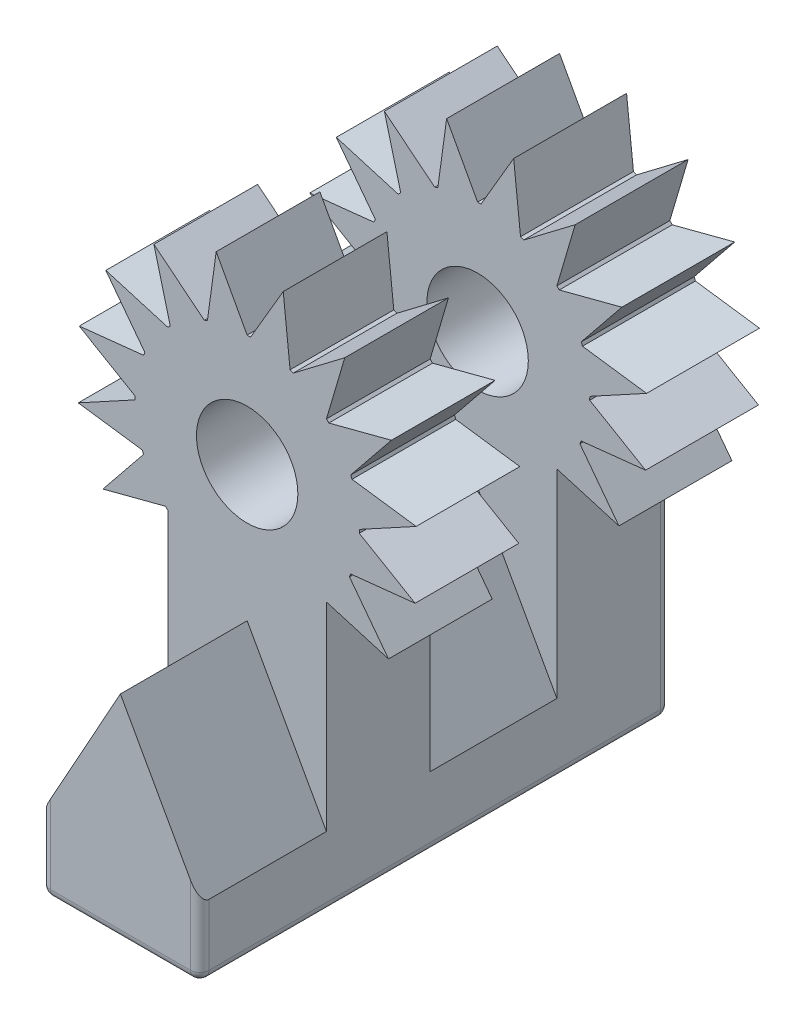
ISO-10303-21;
HEADER;
FILE_DESCRIPTION(('STEP AP214'),'2;1');
FILE_NAME('part.step','',(''),(''),'','','');
FILE_SCHEMA(('AUTOMOTIVE_DESIGN { 1 0 10303 214 1 1 1 1 }'));
ENDSEC;
DATA;
#1=APPLICATION_CONTEXT('core data for automotive mechanical design processes');
#2=APPLICATION_PROTOCOL_DEFINITION('international standard','automotive_design',2000,#1);
#3=PRODUCT_CONTEXT('',#1,'mechanical');
#4=PRODUCT('Part','Part','',(#3));
#5=PRODUCT_RELATED_PRODUCT_CATEGORY('part','',(#4));
#6=PRODUCT_DEFINITION_FORMATION('','',#4);
#7=PRODUCT_DEFINITION_CONTEXT('part definition',#1,'design');
#8=PRODUCT_DEFINITION('design','',#6,#7);
#9=PRODUCT_DEFINITION_SHAPE('','',#8);
#10=(LENGTH_UNIT() NAMED_UNIT(*) SI_UNIT(.MILLI.,.METRE.));
#11=(NAMED_UNIT(*) PLANE_ANGLE_UNIT() SI_UNIT($,.RADIAN.));
#12=(NAMED_UNIT(*) SI_UNIT($,.STERADIAN.) SOLID_ANGLE_UNIT());
#13=UNCERTAINTY_MEASURE_WITH_UNIT(LENGTH_MEASURE(1.E-05),#10,'distance_accuracy_value','');
#14=(GEOMETRIC_REPRESENTATION_CONTEXT(3) GLOBAL_UNCERTAINTY_ASSIGNED_CONTEXT((#13)) GLOBAL_UNIT_ASSIGNED_CONTEXT((#10,
#11,#12)) REPRESENTATION_CONTEXT('',''));
#15=CARTESIAN_POINT('',(0.,0.,0.));
#16=DIRECTION('',(0.,0.,1.));
#17=DIRECTION('',(1.,0.,0.));
#18=AXIS2_PLACEMENT_3D('',#15,#16,#17);
#19=CARTESIAN_POINT('',(0.,6.96546987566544,15.3));
#20=DIRECTION('',(0.,0.,-1.));
#21=DIRECTION('',(-1.,0.,0.));
#22=AXIS2_PLACEMENT_3D('',#19,#20,#21);
#23=CYLINDRICAL_SURFACE('',#22,3.65);
#24=CARTESIAN_POINT('',(0.,6.96546987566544,3.675));
#25=DIRECTION('',(0.,0.,1.));
#26=DIRECTION('',(1.,0.,0.));
#27=AXIS2_PLACEMENT_3D('',#24,#25,#26);
#28=CIRCLE('',#27,3.65);
#29=CARTESIAN_POINT('',(-2.65771448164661,4.46365978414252,3.675));
#30=VERTEX_POINT('',#29);
#31=CARTESIAN_POINT('',(-2.58093975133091,4.38453012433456,3.675));
#32=VERTEX_POINT('',#31);
#33=EDGE_CURVE('E1693',#30,#32,#28,.T.);
#34=ORIENTED_EDGE('',*,*,#33,.F.);
#35=DIRECTION('',(0.,0.,1.));
#36=VECTOR('',#35,1.);
#37=CARTESIAN_POINT('',(-2.65771448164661,4.46365978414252,-2.61395129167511));
#38=LINE('',#37,#36);
#39=CARTESIAN_POINT('',(-2.65771448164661,4.46365978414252,0.));
#40=VERTEX_POINT('',#39);
#41=EDGE_CURVE('E1227',#40,#30,#38,.T.);
#42=ORIENTED_EDGE('',*,*,#41,.F.);
#43=CARTESIAN_POINT('',(0.,6.96546987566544,0.));
#44=DIRECTION('',(0.,0.,1.));
#45=DIRECTION('',(-1.,0.,0.));
#46=AXIS2_PLACEMENT_3D('',#43,#44,#45);
#47=CIRCLE('',#46,3.65);
#48=CARTESIAN_POINT('',(-2.28093975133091,4.11594116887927,0.));
#49=VERTEX_POINT('',#48);
#50=EDGE_CURVE('E702',#40,#49,#47,.T.);
#51=ORIENTED_EDGE('',*,*,#50,.T.);
#52=CARTESIAN_POINT('',(-2.28093975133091,4.11594116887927,0.));
#53=CARTESIAN_POINT('',(-2.30067676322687,4.1317293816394,1.96034787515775E-05));
#54=CARTESIAN_POINT('',(-2.32023676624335,4.14773292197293,0.00194800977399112));
#55=CARTESIAN_POINT('',(-2.35877565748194,4.17991828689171,0.00959640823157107));
#56=CARTESIAN_POINT('',(-2.37774714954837,4.19610034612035,0.0153526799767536));
#57=CARTESIAN_POINT('',(-2.41634577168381,4.22968909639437,0.0314014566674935));
#58=CARTESIAN_POINT('',(-2.43584488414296,4.24705394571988,0.0420941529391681));
#59=CARTESIAN_POINT('',(-2.47264785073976,4.28048880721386,0.0681515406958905));
#60=CARTESIAN_POINT('',(-2.4899604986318,4.29656390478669,0.0834966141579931));
#61=CARTESIAN_POINT('',(-2.51498050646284,4.32018358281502,0.11179287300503));
#62=CARTESIAN_POINT('',(-2.52372422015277,4.32853200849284,0.123164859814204));
#63=CARTESIAN_POINT('',(-2.5397815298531,4.34399452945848,0.147637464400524));
#64=CARTESIAN_POINT('',(-2.5470970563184,4.35111028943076,0.160735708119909));
#65=CARTESIAN_POINT('',(-2.55870543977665,4.36247540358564,0.185974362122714));
#66=CARTESIAN_POINT('',(-2.56330722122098,4.36701158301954,0.197842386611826));
#67=CARTESIAN_POINT('',(-2.57103551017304,4.37465801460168,0.222474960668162));
#68=CARTESIAN_POINT('',(-2.57416526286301,4.37777140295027,0.235237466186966));
#69=CARTESIAN_POINT('',(-2.57792676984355,4.3815197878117,0.256730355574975));
#70=CARTESIAN_POINT('',(-2.57905033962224,4.3826417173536,0.265293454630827));
#71=CARTESIAN_POINT('',(-2.5805595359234,4.38414990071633,0.282568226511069));
#72=CARTESIAN_POINT('',(-2.5809434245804,4.3845344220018,0.291280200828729));
#73=CARTESIAN_POINT('',(-2.58093975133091,4.38453012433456,0.3));
#74=B_SPLINE_CURVE_WITH_KNOTS('',3,(#52,#53,#54,#55,#56,#57,#58,#59,#60,#61,#62,#63,#64,#65,#66,
#67,#68,#69,#70,#71,#72,#73),.UNSPECIFIED.,.F.,.F.,(4,2,2,2,2,2,2,2,2,2,4),(0.,
0.0757489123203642,0.152226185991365,0.236444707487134,0.320312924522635,0.369950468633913,
0.419520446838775,0.459903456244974,0.500197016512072,0.526264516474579,0.552393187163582),.UNSPECIFIED.);
#75=CARTESIAN_POINT('',(-2.58093975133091,4.38453012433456,0.3));
#76=VERTEX_POINT('',#75);
#77=EDGE_CURVE('E120',#49,#76,#74,.T.);
#78=ORIENTED_EDGE('',*,*,#77,.T.);
#79=DIRECTION('',(0.,0.,-1.));
#80=VECTOR('',#79,1.);
#81=CARTESIAN_POINT('',(-2.58093975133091,4.38453012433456,15.3));
#82=LINE('',#81,#80);
#83=EDGE_CURVE('E697',#32,#76,#82,.T.);
#84=ORIENTED_EDGE('',*,*,#83,.F.);
#85=EDGE_LOOP('',(#34,#42,#51,#78,#84));
#86=FACE_BOUND('',#85,.T.);
#87=ADVANCED_FACE('F110',(#86),#23,.T.);
#88=CARTESIAN_POINT('',(0.,6.96546987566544,3.675));
#89=DIRECTION('',(0.,0.,1.));
#90=DIRECTION('',(1.,0.,0.));
#91=AXIS2_PLACEMENT_3D('',#88,#89,#90);
#92=CIRCLE('',#91,3.65);
#93=CARTESIAN_POINT('',(-3.41280928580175,5.67116203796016,3.675));
#94=VERTEX_POINT('',#93);
#95=CARTESIAN_POINT('',(-3.37216029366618,5.56867534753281,3.675));
#96=VERTEX_POINT('',#95);
#97=EDGE_CURVE('E1684',#94,#96,#92,.T.);
#98=ORIENTED_EDGE('',*,*,#97,.F.);
#99=DIRECTION('',(0.,0.,1.));
#100=VECTOR('',#99,1.);
#101=CARTESIAN_POINT('',(-3.41280928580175,5.67116203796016,-2.45477924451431));
#102=LINE('',#101,#100);
#103=CARTESIAN_POINT('',(-3.41280928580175,5.67116203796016,0.));
#104=VERTEX_POINT('',#103);
#105=EDGE_CURVE('E1249',#104,#94,#102,.T.);
#106=ORIENTED_EDGE('',*,*,#105,.F.);
#107=CARTESIAN_POINT('',(-3.37216029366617,5.56867534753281,0.));
#108=VERTEX_POINT('',#107);
#109=EDGE_CURVE('E892',#104,#108,#47,.T.);
#110=ORIENTED_EDGE('',*,*,#109,.T.);
#111=DIRECTION('',(0.,0.,1.));
#112=VECTOR('',#111,1.);
#113=CARTESIAN_POINT('',(-3.37216029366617,5.56867534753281,-2.61395129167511));
#114=LINE('',#113,#112);
#115=EDGE_CURVE('E1224',#108,#96,#114,.T.);
#116=ORIENTED_EDGE('',*,*,#115,.T.);
#117=EDGE_LOOP('',(#98,#106,#110,#116));
#118=FACE_BOUND('',#117,.T.);
#119=ADVANCED_FACE('F819',(#118),#23,.T.);
#120=CARTESIAN_POINT('',(0.,6.96546987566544,3.675));
#121=DIRECTION('',(0.,0.,1.));
#122=DIRECTION('',(1.,0.,0.));
#123=AXIS2_PLACEMENT_3D('',#120,#121,#122);
#124=CIRCLE('',#123,3.65);
#125=CARTESIAN_POINT('',(-3.6483348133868,7.07571092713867,3.675));
#126=VERTEX_POINT('',#125);
#127=CARTESIAN_POINT('',(-3.65,6.96546987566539,3.675));
#128=VERTEX_POINT('',#127);
#129=EDGE_CURVE('E1676',#126,#128,#124,.T.);
#130=ORIENTED_EDGE('',*,*,#129,.F.);
#131=DIRECTION('',(0.,0.,1.));
#132=VECTOR('',#131,1.);
#133=CARTESIAN_POINT('',(-3.6483348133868,7.07571092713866,-2.45726151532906));
#134=LINE('',#133,#132);
#135=CARTESIAN_POINT('',(-3.6483348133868,7.07571092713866,0.));
#136=VERTEX_POINT('',#135);
#137=EDGE_CURVE('E1270',#136,#126,#134,.T.);
#138=ORIENTED_EDGE('',*,*,#137,.F.);
#139=CARTESIAN_POINT('',(-3.65,6.96546987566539,0.));
#140=VERTEX_POINT('',#139);
#141=EDGE_CURVE('E897',#136,#140,#47,.T.);
#142=ORIENTED_EDGE('',*,*,#141,.T.);
#143=DIRECTION('',(0.,0.,1.));
#144=VECTOR('',#143,1.);
#145=CARTESIAN_POINT('',(-3.65,6.96546987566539,-2.45477924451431));
#146=LINE('',#145,#144);
#147=EDGE_CURVE('E1245',#140,#128,#146,.T.);
#148=ORIENTED_EDGE('',*,*,#147,.T.);
#149=EDGE_LOOP('',(#130,#138,#142,#148));
#150=FACE_BOUND('',#149,.T.);
#151=ADVANCED_FACE('F824',(#150),#23,.T.);
#152=CARTESIAN_POINT('',(0.,6.96546987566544,3.675));
#153=DIRECTION('',(0.,0.,1.));
#154=DIRECTION('',(1.,0.,0.));
#155=AXIS2_PLACEMENT_3D('',#152,#153,#154);
#156=CIRCLE('',#155,3.65);
#157=CARTESIAN_POINT('',(-3.32843443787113,8.46347661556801,3.675));
#158=VERTEX_POINT('',#157);
#159=CARTESIAN_POINT('',(-3.37216029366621,8.36226440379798,3.675));
#160=VERTEX_POINT('',#159);
#161=EDGE_CURVE('E1667',#158,#160,#156,.T.);
#162=ORIENTED_EDGE('',*,*,#161,.F.);
#163=DIRECTION('',(0.,0.,1.));
#164=VECTOR('',#163,1.);
#165=CARTESIAN_POINT('',(-3.32843443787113,8.46347661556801,-2.62556228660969));
#166=LINE('',#165,#164);
#167=CARTESIAN_POINT('',(-3.32843443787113,8.46347661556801,0.));
#168=VERTEX_POINT('',#167);
#169=EDGE_CURVE('E1290',#168,#158,#166,.T.);
#170=ORIENTED_EDGE('',*,*,#169,.F.);
#171=CARTESIAN_POINT('',(-3.37216029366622,8.36226440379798,0.));
#172=VERTEX_POINT('',#171);
#173=EDGE_CURVE('E904',#168,#172,#47,.T.);
#174=ORIENTED_EDGE('',*,*,#173,.T.);
#175=DIRECTION('',(0.,0.,1.));
#176=VECTOR('',#175,1.);
#177=CARTESIAN_POINT('',(-3.37216029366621,8.36226440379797,-2.45726151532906));
#178=LINE('',#177,#176);
#179=EDGE_CURVE('E1266',#172,#160,#178,.T.);
#180=ORIENTED_EDGE('',*,*,#179,.T.);
#181=EDGE_LOOP('',(#162,#170,#174,#180));
#182=FACE_BOUND('',#181,.T.);
#183=ADVANCED_FACE('F2043',(#182),#23,.T.);
#184=CARTESIAN_POINT('',(0.,6.96546987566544,3.675));
#185=DIRECTION('',(0.,0.,1.));
#186=DIRECTION('',(1.,0.,0.));
#187=AXIS2_PLACEMENT_3D('',#184,#185,#186);
#188=CIRCLE('',#187,3.65);
#189=CARTESIAN_POINT('',(-2.50181009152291,9.62318435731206,3.675));
#190=VERTEX_POINT('',#189);
#191=CARTESIAN_POINT('',(-2.58093975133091,9.54640962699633,3.675));
#192=VERTEX_POINT('',#191);
#193=EDGE_CURVE('E1428',#190,#192,#188,.T.);
#194=ORIENTED_EDGE('',*,*,#193,.F.);
#195=DIRECTION('',(0.,0.,1.));
#196=VECTOR('',#195,1.);
#197=CARTESIAN_POINT('',(-2.50181009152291,9.62318435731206,-2.61395129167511));
#198=LINE('',#197,#196);
#199=CARTESIAN_POINT('',(-2.50181009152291,9.62318435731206,0.));
#200=VERTEX_POINT('',#199);
#201=EDGE_CURVE('E1310',#200,#190,#198,.T.);
#202=ORIENTED_EDGE('',*,*,#201,.F.);
#203=CARTESIAN_POINT('',(-2.58093975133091,9.54640962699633,0.));
#204=VERTEX_POINT('',#203);
#205=EDGE_CURVE('E912',#200,#204,#47,.T.);
#206=ORIENTED_EDGE('',*,*,#205,.T.);
#207=DIRECTION('',(0.,0.,1.));
#208=VECTOR('',#207,1.);
#209=CARTESIAN_POINT('',(-2.58093975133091,9.54640962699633,-2.62556228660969));
#210=LINE('',#209,#208);
#211=EDGE_CURVE('E1287',#204,#192,#210,.T.);
#212=ORIENTED_EDGE('',*,*,#211,.T.);
#213=EDGE_LOOP('',(#194,#202,#206,#212));
#214=FACE_BOUND('',#213,.T.);
#215=ADVANCED_FACE('F2036',(#214),#23,.T.);
#216=CARTESIAN_POINT('',(0.,6.96546987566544,3.675));
#217=DIRECTION('',(0.,0.,1.));
#218=DIRECTION('',(1.,0.,0.));
#219=AXIS2_PLACEMENT_3D('',#216,#217,#218);
#220=CIRCLE('',#219,3.65);
#221=CARTESIAN_POINT('',(-1.29430783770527,10.3782791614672,3.675));
#222=VERTEX_POINT('',#221);
#223=CARTESIAN_POINT('',(-1.39679452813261,10.3376301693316,3.675));
#224=VERTEX_POINT('',#223);
#225=EDGE_CURVE('E1655',#222,#224,#220,.T.);
#226=ORIENTED_EDGE('',*,*,#225,.F.);
#227=DIRECTION('',(0.,0.,1.));
#228=VECTOR('',#227,1.);
#229=CARTESIAN_POINT('',(-1.29430783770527,10.3782791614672,-2.45477924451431));
#230=LINE('',#229,#228);
#231=CARTESIAN_POINT('',(-1.29430783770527,10.3782791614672,0.));
#232=VERTEX_POINT('',#231);
#233=EDGE_CURVE('E1332',#232,#222,#230,.T.);
#234=ORIENTED_EDGE('',*,*,#233,.F.);
#235=CARTESIAN_POINT('',(-1.39679452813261,10.3376301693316,0.));
#236=VERTEX_POINT('',#235);
#237=EDGE_CURVE('E919',#232,#236,#47,.T.);
#238=ORIENTED_EDGE('',*,*,#237,.T.);
#239=DIRECTION('',(0.,0.,1.));
#240=VECTOR('',#239,1.);
#241=CARTESIAN_POINT('',(-1.39679452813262,10.3376301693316,-2.61395129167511));
#242=LINE('',#241,#240);
#243=EDGE_CURVE('E1307',#236,#224,#242,.T.);
#244=ORIENTED_EDGE('',*,*,#243,.T.);
#245=EDGE_LOOP('',(#226,#234,#238,#244));
#246=FACE_BOUND('',#245,.T.);
#247=ADVANCED_FACE('F2027',(#246),#23,.T.);
#248=CARTESIAN_POINT('',(0.,6.96546987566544,3.675));
#249=DIRECTION('',(0.,0.,1.));
#250=DIRECTION('',(1.,0.,0.));
#251=AXIS2_PLACEMENT_3D('',#248,#249,#250);
#252=CIRCLE('',#251,3.65);
#253=CARTESIAN_POINT('',(0.110241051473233,10.6138046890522,3.675));
#254=VERTEX_POINT('',#253);
#255=CARTESIAN_POINT('',(0.,10.6154698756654,3.675));
#256=VERTEX_POINT('',#255);
#257=EDGE_CURVE('E1647',#254,#256,#252,.T.);
#258=ORIENTED_EDGE('',*,*,#257,.F.);
#259=DIRECTION('',(0.,0.,1.));
#260=VECTOR('',#259,1.);
#261=CARTESIAN_POINT('',(0.110241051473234,10.6138046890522,-2.45726151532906));
#262=LINE('',#261,#260);
#263=CARTESIAN_POINT('',(0.110241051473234,10.6138046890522,0.));
#264=VERTEX_POINT('',#263);
#265=EDGE_CURVE('E1353',#264,#254,#262,.T.);
#266=ORIENTED_EDGE('',*,*,#265,.F.);
#267=CARTESIAN_POINT('',(0.,10.6154698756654,0.));
#268=VERTEX_POINT('',#267);
#269=EDGE_CURVE('E926',#264,#268,#47,.T.);
#270=ORIENTED_EDGE('',*,*,#269,.T.);
#271=DIRECTION('',(0.,0.,1.));
#272=VECTOR('',#271,1.);
#273=CARTESIAN_POINT('',(0.,10.6154698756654,-2.45477924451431));
#274=LINE('',#273,#272);
#275=EDGE_CURVE('E1328',#268,#256,#274,.T.);
#276=ORIENTED_EDGE('',*,*,#275,.T.);
#277=EDGE_LOOP('',(#258,#266,#270,#276));
#278=FACE_BOUND('',#277,.T.);
#279=ADVANCED_FACE('F2020',(#278),#23,.T.);
#280=CARTESIAN_POINT('',(0.,6.96546987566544,3.675));
#281=DIRECTION('',(0.,0.,1.));
#282=DIRECTION('',(1.,0.,0.));
#283=AXIS2_PLACEMENT_3D('',#280,#281,#282);
#284=CIRCLE('',#283,3.65);
#285=CARTESIAN_POINT('',(1.49800673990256,10.2939043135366,3.675));
#286=VERTEX_POINT('',#285);
#287=CARTESIAN_POINT('',(1.39679452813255,10.3376301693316,3.675));
#288=VERTEX_POINT('',#287);
#289=EDGE_CURVE('E1638',#286,#288,#284,.T.);
#290=ORIENTED_EDGE('',*,*,#289,.F.);
#291=DIRECTION('',(0.,0.,1.));
#292=VECTOR('',#291,1.);
#293=CARTESIAN_POINT('',(1.49800673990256,10.2939043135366,-2.62556228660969));
#294=LINE('',#293,#292);
#295=CARTESIAN_POINT('',(1.49800673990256,10.2939043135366,0.));
#296=VERTEX_POINT('',#295);
#297=EDGE_CURVE('E1373',#296,#286,#294,.T.);
#298=ORIENTED_EDGE('',*,*,#297,.F.);
#299=CARTESIAN_POINT('',(1.39679452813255,10.3376301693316,0.));
#300=VERTEX_POINT('',#299);
#301=EDGE_CURVE('E934',#296,#300,#47,.T.);
#302=ORIENTED_EDGE('',*,*,#301,.T.);
#303=DIRECTION('',(0.,0.,1.));
#304=VECTOR('',#303,1.);
#305=CARTESIAN_POINT('',(1.39679452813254,10.3376301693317,-2.45726151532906));
#306=LINE('',#305,#304);
#307=EDGE_CURVE('E1349',#300,#288,#306,.T.);
#308=ORIENTED_EDGE('',*,*,#307,.T.);
#309=EDGE_LOOP('',(#290,#298,#302,#308));
#310=FACE_BOUND('',#309,.T.);
#311=ADVANCED_FACE('F2011',(#310),#23,.T.);
#312=CARTESIAN_POINT('',(0.,6.96546987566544,3.675));
#313=DIRECTION('',(0.,0.,1.));
#314=DIRECTION('',(1.,0.,0.));
#315=AXIS2_PLACEMENT_3D('',#312,#313,#314);
#316=CIRCLE('',#315,3.65);
#317=CARTESIAN_POINT('',(2.65771448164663,9.46727996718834,3.675));
#318=VERTEX_POINT('',#317);
#319=CARTESIAN_POINT('',(2.58093975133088,9.54640962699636,3.675));
#320=VERTEX_POINT('',#319);
#321=EDGE_CURVE('E1629',#318,#320,#316,.T.);
#322=ORIENTED_EDGE('',*,*,#321,.F.);
#323=DIRECTION('',(0.,0.,1.));
#324=VECTOR('',#323,1.);
#325=CARTESIAN_POINT('',(2.65771448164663,9.46727996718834,-2.61395129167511));
#326=LINE('',#325,#324);
#327=CARTESIAN_POINT('',(2.65771448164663,9.46727996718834,0.));
#328=VERTEX_POINT('',#327);
#329=EDGE_CURVE('E1394',#328,#318,#326,.T.);
#330=ORIENTED_EDGE('',*,*,#329,.F.);
#331=CARTESIAN_POINT('',(2.58093975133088,9.54640962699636,0.));
#332=VERTEX_POINT('',#331);
#333=EDGE_CURVE('E942',#328,#332,#47,.T.);
#334=ORIENTED_EDGE('',*,*,#333,.T.);
#335=DIRECTION('',(0.,0.,1.));
#336=VECTOR('',#335,1.);
#337=CARTESIAN_POINT('',(2.58093975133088,9.54640962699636,-2.62556228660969));
#338=LINE('',#337,#336);
#339=EDGE_CURVE('E1370',#332,#320,#338,.T.);
#340=ORIENTED_EDGE('',*,*,#339,.T.);
#341=EDGE_LOOP('',(#322,#330,#334,#340));
#342=FACE_BOUND('',#341,.T.);
#343=ADVANCED_FACE('F2004',(#342),#23,.T.);
#344=CARTESIAN_POINT('',(0.,6.96546987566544,3.675));
#345=DIRECTION('',(0.,0.,1.));
#346=DIRECTION('',(1.,0.,0.));
#347=AXIS2_PLACEMENT_3D('',#344,#345,#346);
#348=CIRCLE('',#347,3.65);
#349=CARTESIAN_POINT('',(3.41280928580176,8.2597777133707,3.675));
#350=VERTEX_POINT('',#349);
#351=CARTESIAN_POINT('',(3.37216029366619,8.36226440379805,3.675));
#352=VERTEX_POINT('',#351);
#353=EDGE_CURVE('E1621',#350,#352,#348,.T.);
#354=ORIENTED_EDGE('',*,*,#353,.F.);
#355=DIRECTION('',(0.,0.,1.));
#356=VECTOR('',#355,1.);
#357=CARTESIAN_POINT('',(3.41280928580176,8.2597777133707,-2.45477924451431));
#358=LINE('',#357,#356);
#359=CARTESIAN_POINT('',(3.41280928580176,8.2597777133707,0.));
#360=VERTEX_POINT('',#359);
#361=EDGE_CURVE('E996',#360,#350,#358,.T.);
#362=ORIENTED_EDGE('',*,*,#361,.F.);
#363=CARTESIAN_POINT('',(3.37216029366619,8.36226440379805,0.));
#364=VERTEX_POINT('',#363);
#365=EDGE_CURVE('E950',#360,#364,#47,.T.);
#366=ORIENTED_EDGE('',*,*,#365,.T.);
#367=DIRECTION('',(0.,0.,1.));
#368=VECTOR('',#367,1.);
#369=CARTESIAN_POINT('',(3.37216029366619,8.36226440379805,-2.61395129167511));
#370=LINE('',#369,#368);
#371=EDGE_CURVE('E1390',#364,#352,#370,.T.);
#372=ORIENTED_EDGE('',*,*,#371,.T.);
#373=EDGE_LOOP('',(#354,#362,#366,#372));
#374=FACE_BOUND('',#373,.T.);
#375=ADVANCED_FACE('F1995',(#374),#23,.T.);
#376=CARTESIAN_POINT('',(0.,6.96546987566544,3.675));
#377=DIRECTION('',(0.,0.,1.));
#378=DIRECTION('',(1.,0.,0.));
#379=AXIS2_PLACEMENT_3D('',#376,#377,#378);
#380=CIRCLE('',#379,3.65);
#381=CARTESIAN_POINT('',(3.6483348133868,6.85522882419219,3.675));
#382=VERTEX_POINT('',#381);
#383=CARTESIAN_POINT('',(3.65,6.96546987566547,3.675));
#384=VERTEX_POINT('',#383);
#385=EDGE_CURVE('E1614',#382,#384,#380,.T.);
#386=ORIENTED_EDGE('',*,*,#385,.F.);
#387=DIRECTION('',(0.,0.,1.));
#388=VECTOR('',#387,1.);
#389=CARTESIAN_POINT('',(3.6483348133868,6.85522882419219,-2.45726151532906));
#390=LINE('',#389,#388);
#391=CARTESIAN_POINT('',(3.6483348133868,6.85522882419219,0.));
#392=VERTEX_POINT('',#391);
#393=EDGE_CURVE('E975',#392,#382,#390,.T.);
#394=ORIENTED_EDGE('',*,*,#393,.F.);
#395=CARTESIAN_POINT('',(3.65,6.96546987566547,0.));
#396=VERTEX_POINT('',#395);
#397=EDGE_CURVE('E700',#392,#396,#47,.T.);
#398=ORIENTED_EDGE('',*,*,#397,.T.);
#399=DIRECTION('',(0.,0.,1.));
#400=VECTOR('',#399,1.);
#401=CARTESIAN_POINT('',(3.65,6.96546987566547,-2.45477924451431));
#402=LINE('',#401,#400);
#403=EDGE_CURVE('E973',#396,#384,#402,.T.);
#404=ORIENTED_EDGE('',*,*,#403,.T.);
#405=EDGE_LOOP('',(#386,#394,#398,#404));
#406=FACE_BOUND('',#405,.T.);
#407=ADVANCED_FACE('F971',(#406),#23,.T.);
#408=CARTESIAN_POINT('',(0.,6.96546987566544,3.675));
#409=DIRECTION('',(0.,0.,1.));
#410=DIRECTION('',(1.,0.,0.));
#411=AXIS2_PLACEMENT_3D('',#408,#409,#410);
#412=CIRCLE('',#411,3.65);
#413=CARTESIAN_POINT('',(3.32843443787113,5.46746313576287,3.675));
#414=VERTEX_POINT('',#413);
#415=CARTESIAN_POINT('',(3.37216029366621,5.56867534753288,3.675));
#416=VERTEX_POINT('',#415);
#417=EDGE_CURVE('E1602',#414,#416,#412,.T.);
#418=ORIENTED_EDGE('',*,*,#417,.F.);
#419=DIRECTION('',(0.,0.,1.));
#420=VECTOR('',#419,1.);
#421=CARTESIAN_POINT('',(3.32843443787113,5.46746313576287,-2.62556228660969));
#422=LINE('',#421,#420);
#423=CARTESIAN_POINT('',(3.32843443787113,5.46746313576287,0.));
#424=VERTEX_POINT('',#423);
#425=EDGE_CURVE('E868',#424,#414,#422,.T.);
#426=ORIENTED_EDGE('',*,*,#425,.F.);
#427=CARTESIAN_POINT('',(3.37216029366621,5.56867534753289,0.));
#428=VERTEX_POINT('',#427);
#429=EDGE_CURVE('E691',#424,#428,#47,.T.);
#430=ORIENTED_EDGE('',*,*,#429,.T.);
#431=DIRECTION('',(0.,0.,1.));
#432=VECTOR('',#431,1.);
#433=CARTESIAN_POINT('',(3.37216029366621,5.56867534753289,-2.45726151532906));
#434=LINE('',#433,#432);
#435=EDGE_CURVE('E1014',#428,#416,#434,.T.);
#436=ORIENTED_EDGE('',*,*,#435,.T.);
#437=EDGE_LOOP('',(#418,#426,#430,#436));
#438=FACE_BOUND('',#437,.T.);
#439=ADVANCED_FACE('F837',(#438),#23,.T.);
#440=CARTESIAN_POINT('',(0.,6.96546987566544,15.3));
#441=DIRECTION('',(0.,0.,-1.));
#442=DIRECTION('',(-1.,0.,0.));
#443=AXIS2_PLACEMENT_3D('',#440,#441,#442);
#444=CYLINDRICAL_SURFACE('',#443,1.65);
#445=CARTESIAN_POINT('',(0.,6.96546987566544,0.));
#446=DIRECTION('',(0.,0.,1.));
#447=DIRECTION('',(1.,0.,0.));
#448=AXIS2_PLACEMENT_3D('',#445,#446,#447);
#449=CIRCLE('',#448,1.65);
#450=CARTESIAN_POINT('',(1.65,6.96546987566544,0.));
#451=VERTEX_POINT('',#450);
#452=EDGE_CURVE('E883',#451,#451,#449,.T.);
#453=ORIENTED_EDGE('',*,*,#452,.F.);
#454=EDGE_LOOP('',(#453));
#455=FACE_BOUND('',#454,.T.);
#456=CARTESIAN_POINT('',(0.,6.96546987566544,3.675));
#457=DIRECTION('',(0.,0.,1.));
#458=DIRECTION('',(1.,0.,0.));
#459=AXIS2_PLACEMENT_3D('',#456,#457,#458);
#460=CIRCLE('',#459,1.65);
#461=CARTESIAN_POINT('',(1.65,6.96546987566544,3.675));
#462=VERTEX_POINT('',#461);
#463=EDGE_CURVE('E1431',#462,#462,#460,.F.);
#464=ORIENTED_EDGE('',*,*,#463,.F.);
#465=EDGE_LOOP('',(#464));
#466=FACE_BOUND('',#465,.T.);
#467=ADVANCED_FACE('F852',(#455,#466),#444,.F.);
#468=CARTESIAN_POINT('',(4.74553628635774,3.59882118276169,-2.62556228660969));
#469=DIRECTION('',(0.796791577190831,0.604254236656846,0.));
#470=DIRECTION('',(-0.604254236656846,0.796791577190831,0.));
#471=AXIS2_PLACEMENT_3D('',#468,#469,#470);
#472=PLANE('',#471);
#473=ORIENTED_EDGE('',*,*,#425,.T.);
#474=DIRECTION('',(-0.604254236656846,0.796791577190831,0.));
#475=VECTOR('',#474,1.);
#476=CARTESIAN_POINT('',(4.74553628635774,3.59882118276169,3.675));
#477=LINE('',#476,#475);
#478=CARTESIAN_POINT('',(4.60065482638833,3.78986713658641,3.675));
#479=VERTEX_POINT('',#478);
#480=EDGE_CURVE('E683',#479,#414,#477,.T.);
#481=ORIENTED_EDGE('',*,*,#480,.F.);
#482=DIRECTION('',(0.,0.,1.));
#483=VECTOR('',#482,1.);
#484=CARTESIAN_POINT('',(4.60065482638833,3.78986713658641,-2.62556228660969));
#485=LINE('',#484,#483);
#486=CARTESIAN_POINT('',(4.60065482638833,3.78986713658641,0.));
#487=VERTEX_POINT('',#486);
#488=EDGE_CURVE('E681',#487,#479,#485,.T.);
#489=ORIENTED_EDGE('',*,*,#488,.F.);
#490=DIRECTION('',(-0.604254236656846,0.796791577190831,0.));
#491=VECTOR('',#490,1.);
#492=CARTESIAN_POINT('',(4.74553628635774,3.59882118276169,0.));
#493=LINE('',#492,#491);
#494=EDGE_CURVE('E869',#487,#424,#493,.T.);
#495=ORIENTED_EDGE('',*,*,#494,.T.);
#496=EDGE_LOOP('',(#473,#481,#489,#495));
#497=FACE_BOUND('',#496,.T.);
#498=ADVANCED_FACE('F1717',(#497),#472,.T.);
#499=CARTESIAN_POINT('',(1.39384127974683,4.73404651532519,-2.62556228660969));
#500=DIRECTION('',(-0.282441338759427,-0.959284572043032,0.));
#501=DIRECTION('',(0.959284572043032,-0.282441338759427,0.));
#502=AXIS2_PLACEMENT_3D('',#499,#500,#501);
#503=PLANE('',#502);
#504=ORIENTED_EDGE('',*,*,#488,.T.);
#505=DIRECTION('',(0.959284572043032,-0.282441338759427,0.));
#506=VECTOR('',#505,1.);
#507=CARTESIAN_POINT('',(1.39384127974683,4.73404651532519,3.675));
#508=LINE('',#507,#506);
#509=CARTESIAN_POINT('',(2.58093975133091,4.38453012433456,3.675));
#510=VERTEX_POINT('',#509);
#511=EDGE_CURVE('E662',#510,#479,#508,.T.);
#512=ORIENTED_EDGE('',*,*,#511,.F.);
#513=DIRECTION('',(0.,0.,-1.));
#514=VECTOR('',#513,1.);
#515=CARTESIAN_POINT('',(2.58093975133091,4.38453012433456,15.3));
#516=LINE('',#515,#514);
#517=CARTESIAN_POINT('',(2.58093975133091,4.38453012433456,0.3));
#518=VERTEX_POINT('',#517);
#519=EDGE_CURVE('E677',#510,#518,#516,.T.);
#520=ORIENTED_EDGE('',*,*,#519,.T.);
#521=CARTESIAN_POINT('',(2.28093975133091,4.47285886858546,0.3));
#522=DIRECTION('',(-0.282441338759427,-0.959284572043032,0.));
#523=DIRECTION('',(0.959284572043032,-0.282441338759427,0.));
#524=AXIS2_PLACEMENT_3D('',#521,#522,#523);
#525=ELLIPSE('',#524,0.312733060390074,0.3);
#526=CARTESIAN_POINT('',(2.28093975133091,4.47285886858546,0.));
#527=VERTEX_POINT('',#526);
#528=EDGE_CURVE('E12',#518,#527,#525,.F.);
#529=ORIENTED_EDGE('',*,*,#528,.T.);
#530=DIRECTION('',(0.959284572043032,-0.282441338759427,0.));
#531=VECTOR('',#530,1.);
#532=CARTESIAN_POINT('',(1.39384127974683,4.73404651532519,0.));
#533=LINE('',#532,#531);
#534=EDGE_CURVE('E875',#527,#487,#533,.T.);
#535=ORIENTED_EDGE('',*,*,#534,.T.);
#536=EDGE_LOOP('',(#504,#512,#520,#529,#535));
#537=FACE_BOUND('',#536,.T.);
#538=ADVANCED_FACE('F676',(#537),#503,.T.);
#539=CARTESIAN_POINT('',(5.67266452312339,5.67113016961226,-2.45726151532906));
#540=DIRECTION('',(0.504901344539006,0.863177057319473,0.));
#541=DIRECTION('',(-0.863177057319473,0.504901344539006,0.));
#542=AXIS2_PLACEMENT_3D('',#539,#540,#541);
#543=PLANE('',#542);
#544=ORIENTED_EDGE('',*,*,#393,.T.);
#545=DIRECTION('',(-0.863177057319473,0.504901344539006,0.));
#546=VECTOR('',#545,1.);
#547=CARTESIAN_POINT('',(3.9176938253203,6.69767166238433,3.675));
#548=LINE('',#547,#546);
#549=CARTESIAN_POINT('',(5.46570138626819,5.79218988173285,3.675));
#550=VERTEX_POINT('',#549);
#551=EDGE_CURVE('E1611',#550,#382,#548,.T.);
#552=ORIENTED_EDGE('',*,*,#551,.F.);
#553=DIRECTION('',(0.,0.,1.));
#554=VECTOR('',#553,1.);
#555=CARTESIAN_POINT('',(5.4657013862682,5.79218988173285,-2.45726151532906));
#556=LINE('',#555,#554);
#557=CARTESIAN_POINT('',(5.4657013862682,5.79218988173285,0.));
#558=VERTEX_POINT('',#557);
#559=EDGE_CURVE('E878',#558,#550,#556,.T.);
#560=ORIENTED_EDGE('',*,*,#559,.F.);
#561=DIRECTION('',(-0.863177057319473,0.504901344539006,0.));
#562=VECTOR('',#561,1.);
#563=CARTESIAN_POINT('',(5.67266452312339,5.67113016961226,0.));
#564=LINE('',#563,#562);
#565=EDGE_CURVE('E1005',#558,#392,#564,.T.);
#566=ORIENTED_EDGE('',*,*,#565,.T.);
#567=EDGE_LOOP('',(#544,#552,#560,#566));
#568=FACE_BOUND('',#567,.T.);
#569=ADVANCED_FACE('F1724',(#568),#543,.T.);
#570=CARTESIAN_POINT('',(2.14167018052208,5.4373034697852,-2.45726151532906));
#571=DIRECTION('',(0.106160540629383,-0.994349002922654,0.));
#572=DIRECTION('',(0.994349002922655,0.106160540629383,0.));
#573=AXIS2_PLACEMENT_3D('',#570,#571,#572);
#574=PLANE('',#573);
#575=ORIENTED_EDGE('',*,*,#559,.T.);
#576=DIRECTION('',(0.994349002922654,0.106160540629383,0.));
#577=VECTOR('',#576,1.);
#578=CARTESIAN_POINT('',(-0.549828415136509,5.1499486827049,3.675));
#579=LINE('',#578,#577);
#580=EDGE_CURVE('E1606',#416,#550,#579,.T.);
#581=ORIENTED_EDGE('',*,*,#580,.F.);
#582=ORIENTED_EDGE('',*,*,#435,.F.);
#583=DIRECTION('',(0.994349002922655,0.106160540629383,0.));
#584=VECTOR('',#583,1.);
#585=CARTESIAN_POINT('',(2.14167018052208,5.4373034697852,0.));
#586=LINE('',#585,#584);
#587=EDGE_CURVE('E1009',#428,#558,#586,.T.);
#588=ORIENTED_EDGE('',*,*,#587,.T.);
#589=EDGE_LOOP('',(#575,#581,#582,#588));
#590=FACE_BOUND('',#589,.T.);
#591=ADVANCED_FACE('F1721',(#590),#574,.T.);
#592=CARTESIAN_POINT('',(5.73618100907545,7.94049064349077,-2.45477924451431));
#593=DIRECTION('',(0.136144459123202,0.990688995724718,0.));
#594=DIRECTION('',(-0.990688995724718,0.136144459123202,0.));
#595=AXIS2_PLACEMENT_3D('',#592,#593,#594);
#596=PLANE('',#595);
#597=ORIENTED_EDGE('',*,*,#361,.T.);
#598=DIRECTION('',(-0.990688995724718,0.136144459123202,0.));
#599=VECTOR('',#598,1.);
#600=CARTESIAN_POINT('',(1.17731002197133,8.56698899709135,3.675));
#601=LINE('',#600,#599);
#602=CARTESIAN_POINT('',(5.49864445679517,7.9731338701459,3.675));
#603=VERTEX_POINT('',#602);
#604=EDGE_CURVE('E1618',#603,#350,#601,.T.);
#605=ORIENTED_EDGE('',*,*,#604,.F.);
#606=DIRECTION('',(0.,0.,1.));
#607=VECTOR('',#606,1.);
#608=CARTESIAN_POINT('',(5.49864445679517,7.9731338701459,-2.45477924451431));
#609=LINE('',#608,#607);
#610=CARTESIAN_POINT('',(5.49864445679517,7.9731338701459,0.));
#611=VERTEX_POINT('',#610);
#612=EDGE_CURVE('E1002',#611,#603,#609,.T.);
#613=ORIENTED_EDGE('',*,*,#612,.F.);
#614=DIRECTION('',(-0.990688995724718,0.136144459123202,0.));
#615=VECTOR('',#614,1.);
#616=CARTESIAN_POINT('',(5.73618100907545,7.94049064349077,0.));
#617=LINE('',#616,#615);
#618=EDGE_CURVE('E981',#611,#360,#617,.T.);
#619=ORIENTED_EDGE('',*,*,#618,.T.);
#620=EDGE_LOOP('',(#597,#605,#613,#619));
#621=FACE_BOUND('',#620,.T.);
#622=ADVANCED_FACE('F1731',(#621),#596,.T.);
#623=CARTESIAN_POINT('',(2.56344921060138,6.3732099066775,-2.45477924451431));
#624=DIRECTION('',(0.478600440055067,-0.87803281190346,0.));
#625=DIRECTION('',(0.87803281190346,0.478600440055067,0.));
#626=AXIS2_PLACEMENT_3D('',#623,#624,#625);
#627=PLANE('',#626);
#628=ORIENTED_EDGE('',*,*,#612,.T.);
#629=DIRECTION('',(0.87803281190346,0.478600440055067,0.));
#630=VECTOR('',#629,1.);
#631=CARTESIAN_POINT('',(-2.09101465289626,3.83614247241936,3.675));
#632=LINE('',#631,#630);
#633=EDGE_CURVE('E990',#384,#603,#632,.T.);
#634=ORIENTED_EDGE('',*,*,#633,.F.);
#635=ORIENTED_EDGE('',*,*,#403,.F.);
#636=DIRECTION('',(0.87803281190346,0.478600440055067,0.));
#637=VECTOR('',#636,1.);
#638=CARTESIAN_POINT('',(2.56344921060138,6.3732099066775,0.));
#639=LINE('',#638,#637);
#640=EDGE_CURVE('E978',#396,#611,#639,.T.);
#641=ORIENTED_EDGE('',*,*,#640,.T.);
#642=EDGE_LOOP('',(#628,#634,#635,#641));
#643=FACE_BOUND('',#642,.T.);
#644=ADVANCED_FACE('F989',(#643),#627,.T.);
#645=CARTESIAN_POINT('',(4.9264159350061,10.0614130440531,-2.61395129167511));
#646=DIRECTION('',(-0.253339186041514,0.967377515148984,0.));
#647=DIRECTION('',(-0.967377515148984,-0.253339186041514,0.));
#648=AXIS2_PLACEMENT_3D('',#645,#646,#647);
#649=PLANE('',#648);
#650=ORIENTED_EDGE('',*,*,#329,.T.);
#651=DIRECTION('',(-0.967377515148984,-0.253339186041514,0.));
#652=VECTOR('',#651,1.);
#653=CARTESIAN_POINT('',(-2.14961606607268,8.20832450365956,3.675));
#654=LINE('',#653,#652);
#655=CARTESIAN_POINT('',(4.6944687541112,10.0006701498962,3.675));
#656=VERTEX_POINT('',#655);
#657=EDGE_CURVE('E1626',#656,#318,#654,.T.);
#658=ORIENTED_EDGE('',*,*,#657,.F.);
#659=DIRECTION('',(0.,0.,1.));
#660=VECTOR('',#659,1.);
#661=CARTESIAN_POINT('',(4.6944687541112,10.0006701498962,-2.61395129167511));
#662=LINE('',#661,#660);
#663=CARTESIAN_POINT('',(4.6944687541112,10.0006701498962,0.));
#664=VERTEX_POINT('',#663);
#665=EDGE_CURVE('E1397',#664,#656,#662,.T.);
#666=ORIENTED_EDGE('',*,*,#665,.F.);
#667=DIRECTION('',(-0.967377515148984,-0.253339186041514,0.));
#668=VECTOR('',#667,1.);
#669=CARTESIAN_POINT('',(4.9264159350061,10.0614130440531,0.));
#670=LINE('',#669,#668);
#671=EDGE_CURVE('E1381',#664,#328,#670,.T.);
#672=ORIENTED_EDGE('',*,*,#671,.T.);
#673=EDGE_LOOP('',(#650,#658,#666,#672));
#674=FACE_BOUND('',#673,.T.);
#675=ADVANCED_FACE('F1982',(#674),#649,.T.);
#676=CARTESIAN_POINT('',(2.59496633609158,7.39928255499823,-2.61395129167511));
#677=DIRECTION('',(0.778177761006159,-0.628044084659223,0.));
#678=DIRECTION('',(0.628044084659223,0.778177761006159,0.));
#679=AXIS2_PLACEMENT_3D('',#676,#677,#678);
#680=PLANE('',#679);
#681=ORIENTED_EDGE('',*,*,#665,.T.);
#682=DIRECTION('',(0.628044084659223,0.778177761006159,0.));
#683=VECTOR('',#682,1.);
#684=CARTESIAN_POINT('',(-2.04484147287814,1.6503306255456,3.675));
#685=LINE('',#684,#683);
#686=EDGE_CURVE('E1623',#352,#656,#685,.T.);
#687=ORIENTED_EDGE('',*,*,#686,.F.);
#688=ORIENTED_EDGE('',*,*,#371,.F.);
#689=DIRECTION('',(0.628044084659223,0.778177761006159,0.));
#690=VECTOR('',#689,1.);
#691=CARTESIAN_POINT('',(2.59496633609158,7.39928255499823,0.));
#692=LINE('',#691,#690);
#693=EDGE_CURVE('E1385',#364,#664,#692,.T.);
#694=ORIENTED_EDGE('',*,*,#693,.T.);
#695=EDGE_LOOP('',(#681,#687,#688,#694));
#696=FACE_BOUND('',#695,.T.);
#697=ADVANCED_FACE('F1977',(#696),#680,.T.);
#698=CARTESIAN_POINT('',(3.36664869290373,11.7110061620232,-2.62556228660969));
#699=DIRECTION('',(-0.604254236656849,0.796791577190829,0.));
#700=DIRECTION('',(-0.796791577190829,-0.604254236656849,0.));
#701=AXIS2_PLACEMENT_3D('',#698,#699,#700);
#702=PLANE('',#701);
#703=ORIENTED_EDGE('',*,*,#297,.T.);
#704=DIRECTION('',(-0.796791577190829,-0.604254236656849,0.));
#705=VECTOR('',#704,1.);
#706=CARTESIAN_POINT('',(-4.40919442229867,5.81412386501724,3.675));
#707=LINE('',#706,#705);
#708=CARTESIAN_POINT('',(3.17560273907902,11.5661247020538,3.675));
#709=VERTEX_POINT('',#708);
#710=EDGE_CURVE('E1635',#709,#286,#707,.T.);
#711=ORIENTED_EDGE('',*,*,#710,.F.);
#712=DIRECTION('',(0.,0.,1.));
#713=VECTOR('',#712,1.);
#714=CARTESIAN_POINT('',(3.17560273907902,11.5661247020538,-2.62556228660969));
#715=LINE('',#714,#713);
#716=CARTESIAN_POINT('',(3.17560273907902,11.5661247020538,0.));
#717=VERTEX_POINT('',#716);
#718=EDGE_CURVE('E1377',#717,#709,#715,.T.);
#719=ORIENTED_EDGE('',*,*,#718,.F.);
#720=DIRECTION('',(-0.796791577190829,-0.604254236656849,0.));
#721=VECTOR('',#720,1.);
#722=CARTESIAN_POINT('',(3.36664869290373,11.7110061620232,0.));
#723=LINE('',#722,#721);
#724=EDGE_CURVE('E1360',#717,#296,#723,.T.);
#725=ORIENTED_EDGE('',*,*,#724,.T.);
#726=EDGE_LOOP('',(#703,#711,#719,#725));
#727=FACE_BOUND('',#726,.T.);
#728=ADVANCED_FACE('F1973',(#727),#702,.T.);
#729=CARTESIAN_POINT('',(2.23142336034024,8.35931115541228,-2.62556228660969));
#730=DIRECTION('',(0.959284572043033,-0.282441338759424,0.));
#731=DIRECTION('',(0.282441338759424,0.959284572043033,0.));
#732=AXIS2_PLACEMENT_3D('',#729,#730,#731);
#733=PLANE('',#732);
#734=ORIENTED_EDGE('',*,*,#718,.T.);
#735=DIRECTION('',(0.282441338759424,0.959284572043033,0.));
#736=VECTOR('',#735,1.);
#737=CARTESIAN_POINT('',(-0.211469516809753,0.0622627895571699,3.675));
#738=LINE('',#737,#736);
#739=EDGE_CURVE('E1632',#320,#709,#738,.T.);
#740=ORIENTED_EDGE('',*,*,#739,.F.);
#741=ORIENTED_EDGE('',*,*,#339,.F.);
#742=DIRECTION('',(0.282441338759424,0.959284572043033,0.));
#743=VECTOR('',#742,1.);
#744=CARTESIAN_POINT('',(2.23142336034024,8.35931115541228,0.));
#745=LINE('',#744,#743);
#746=EDGE_CURVE('E1365',#332,#717,#745,.T.);
#747=ORIENTED_EDGE('',*,*,#746,.T.);
#748=EDGE_LOOP('',(#734,#740,#741,#747));
#749=FACE_BOUND('',#748,.T.);
#750=ADVANCED_FACE('F1968',(#749),#733,.T.);
#751=CARTESIAN_POINT('',(1.29433970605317,12.6381343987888,-2.45726151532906));
#752=DIRECTION('',(-0.863177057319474,0.504901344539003,0.));
#753=DIRECTION('',(-0.504901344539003,-0.863177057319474,0.));
#754=AXIS2_PLACEMENT_3D('',#751,#752,#753);
#755=PLANE('',#754);
#756=ORIENTED_EDGE('',*,*,#265,.T.);
#757=DIRECTION('',(-0.504901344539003,-0.863177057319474,0.));
#758=VECTOR('',#757,1.);
#759=CARTESIAN_POINT('',(-4.54356266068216,2.65768289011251,3.675));
#760=LINE('',#759,#758);
#761=CARTESIAN_POINT('',(1.17327999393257,12.4311712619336,3.675));
#762=VERTEX_POINT('',#761);
#763=EDGE_CURVE('E1644',#762,#254,#760,.T.);
#764=ORIENTED_EDGE('',*,*,#763,.F.);
#765=DIRECTION('',(0.,0.,1.));
#766=VECTOR('',#765,1.);
#767=CARTESIAN_POINT('',(1.17327999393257,12.4311712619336,-2.45726151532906));
#768=LINE('',#767,#766);
#769=CARTESIAN_POINT('',(1.17327999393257,12.4311712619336,0.));
#770=VERTEX_POINT('',#769);
#771=EDGE_CURVE('E1356',#770,#762,#768,.T.);
#772=ORIENTED_EDGE('',*,*,#771,.F.);
#773=DIRECTION('',(-0.504901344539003,-0.863177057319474,0.));
#774=VECTOR('',#773,1.);
#775=CARTESIAN_POINT('',(1.29433970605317,12.6381343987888,0.));
#776=LINE('',#775,#774);
#777=EDGE_CURVE('E1339',#770,#264,#776,.T.);
#778=ORIENTED_EDGE('',*,*,#777,.T.);
#779=EDGE_LOOP('',(#756,#764,#772,#778));
#780=FACE_BOUND('',#779,.T.);
#781=ADVANCED_FACE('F1963',(#780),#755,.T.);
#782=CARTESIAN_POINT('',(1.52816640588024,9.10714005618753,-2.45726151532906));
#783=DIRECTION('',(0.994349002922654,0.106160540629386,0.));
#784=DIRECTION('',(-0.106160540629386,0.994349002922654,0.));
#785=AXIS2_PLACEMENT_3D('',#782,#783,#784);
#786=PLANE('',#785);
#787=ORIENTED_EDGE('',*,*,#771,.T.);
#788=DIRECTION('',(-0.106160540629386,0.994349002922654,0.));
#789=VECTOR('',#788,1.);
#790=CARTESIAN_POINT('',(2.47229929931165,0.263952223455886,3.675));
#791=LINE('',#790,#789);
#792=EDGE_CURVE('E1641',#288,#762,#791,.T.);
#793=ORIENTED_EDGE('',*,*,#792,.F.);
#794=ORIENTED_EDGE('',*,*,#307,.F.);
#795=DIRECTION('',(-0.106160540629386,0.994349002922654,0.));
#796=VECTOR('',#795,1.);
#797=CARTESIAN_POINT('',(1.52816640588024,9.10714005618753,0.));
#798=LINE('',#797,#796);
#799=EDGE_CURVE('E1344',#300,#770,#798,.T.);
#800=ORIENTED_EDGE('',*,*,#799,.T.);
#801=EDGE_LOOP('',(#787,#793,#794,#800));
#802=FACE_BOUND('',#801,.T.);
#803=ADVANCED_FACE('F1958',(#802),#786,.T.);
#804=CARTESIAN_POINT('',(-0.975020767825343,12.7016508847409,-2.45477924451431));
#805=DIRECTION('',(-0.990688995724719,0.136144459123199,0.));
#806=DIRECTION('',(-0.136144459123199,-0.990688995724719,0.));
#807=AXIS2_PLACEMENT_3D('',#804,#805,#806);
#808=PLANE('',#807);
#809=ORIENTED_EDGE('',*,*,#233,.T.);
#810=DIRECTION('',(-0.136144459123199,-0.990688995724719,0.));
#811=VECTOR('',#810,1.);
#812=CARTESIAN_POINT('',(-2.6701067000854,0.366936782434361,3.675));
#813=LINE('',#812,#811);
#814=CARTESIAN_POINT('',(-1.00766399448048,12.4641143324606,3.675));
#815=VERTEX_POINT('',#814);
#816=EDGE_CURVE('E1653',#815,#222,#813,.T.);
#817=ORIENTED_EDGE('',*,*,#816,.F.);
#818=DIRECTION('',(0.,0.,1.));
#819=VECTOR('',#818,1.);
#820=CARTESIAN_POINT('',(-1.00766399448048,12.4641143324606,-2.45477924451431));
#821=LINE('',#820,#819);
#822=CARTESIAN_POINT('',(-1.00766399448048,12.4641143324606,0.));
#823=VERTEX_POINT('',#822);
#824=EDGE_CURVE('E1335',#823,#815,#821,.T.);
#825=ORIENTED_EDGE('',*,*,#824,.F.);
#826=DIRECTION('',(-0.136144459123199,-0.990688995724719,0.));
#827=VECTOR('',#826,1.);
#828=CARTESIAN_POINT('',(-0.975020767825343,12.7016508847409,0.));
#829=LINE('',#828,#827);
#830=EDGE_CURVE('E1318',#823,#232,#829,.T.);
#831=ORIENTED_EDGE('',*,*,#830,.T.);
#832=EDGE_LOOP('',(#809,#817,#825,#831));
#833=FACE_BOUND('',#832,.T.);
#834=ADVANCED_FACE('F1953',(#833),#808,.T.);
#835=CARTESIAN_POINT('',(0.59225996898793,9.52891908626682,-2.45477924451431));
#836=DIRECTION('',(0.878032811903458,0.47860044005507,0.));
#837=DIRECTION('',(-0.47860044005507,0.878032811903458,0.));
#838=AXIS2_PLACEMENT_3D('',#835,#836,#837);
#839=PLANE('',#838);
#840=ORIENTED_EDGE('',*,*,#824,.T.);
#841=DIRECTION('',(-0.47860044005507,0.878032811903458,0.));
#842=VECTOR('',#841,1.);
#843=CARTESIAN_POINT('',(4.46090589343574,2.43156234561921,3.675));
#844=LINE('',#843,#842);
#845=EDGE_CURVE('E1650',#256,#815,#844,.T.);
#846=ORIENTED_EDGE('',*,*,#845,.F.);
#847=ORIENTED_EDGE('',*,*,#275,.F.);
#848=DIRECTION('',(-0.47860044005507,0.878032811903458,0.));
#849=VECTOR('',#848,1.);
#850=CARTESIAN_POINT('',(0.59225996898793,9.52891908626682,0.));
#851=LINE('',#850,#849);
#852=EDGE_CURVE('E1323',#268,#823,#851,.T.);
#853=ORIENTED_EDGE('',*,*,#852,.T.);
#854=EDGE_LOOP('',(#840,#846,#847,#853));
#855=FACE_BOUND('',#854,.T.);
#856=ADVANCED_FACE('F1948',(#855),#839,.T.);
#857=CARTESIAN_POINT('',(-3.09594316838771,11.8918858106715,-2.61395129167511));
#858=DIRECTION('',(-0.967377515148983,-0.253339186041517,0.));
#859=DIRECTION('',(0.253339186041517,-0.967377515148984,0.));
#860=AXIS2_PLACEMENT_3D('',#857,#858,#859);
#861=PLANE('',#860);
#862=ORIENTED_EDGE('',*,*,#201,.T.);
#863=DIRECTION('',(0.253339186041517,-0.967377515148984,0.));
#864=VECTOR('',#863,1.);
#865=CARTESIAN_POINT('',(0.0171563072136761,0.0044929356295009,3.675));
#866=LINE('',#865,#864);
#867=CARTESIAN_POINT('',(-3.03520027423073,11.6599386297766,3.675));
#868=VERTEX_POINT('',#867);
#869=EDGE_CURVE('E1427',#868,#190,#866,.T.);
#870=ORIENTED_EDGE('',*,*,#869,.F.);
#871=DIRECTION('',(0.,0.,1.));
#872=VECTOR('',#871,1.);
#873=CARTESIAN_POINT('',(-3.03520027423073,11.6599386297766,-2.61395129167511));
#874=LINE('',#873,#872);
#875=CARTESIAN_POINT('',(-3.03520027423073,11.6599386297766,0.));
#876=VERTEX_POINT('',#875);
#877=EDGE_CURVE('E1314',#876,#868,#874,.T.);
#878=ORIENTED_EDGE('',*,*,#877,.F.);
#879=DIRECTION('',(0.253339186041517,-0.967377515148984,0.));
#880=VECTOR('',#879,1.);
#881=CARTESIAN_POINT('',(-3.09594316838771,11.8918858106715,0.));
#882=LINE('',#881,#880);
#883=EDGE_CURVE('E1297',#876,#200,#882,.T.);
#884=ORIENTED_EDGE('',*,*,#883,.T.);
#885=EDGE_LOOP('',(#862,#870,#878,#884));
#886=FACE_BOUND('',#885,.T.);
#887=ADVANCED_FACE('F1943',(#886),#861,.T.);
#888=CARTESIAN_POINT('',(-0.433812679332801,9.56043621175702,-2.61395129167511));
#889=DIRECTION('',(0.62804408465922,0.778177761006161,0.));
#890=DIRECTION('',(-0.778177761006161,0.62804408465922,0.));
#891=AXIS2_PLACEMENT_3D('',#888,#889,#890);
#892=PLANE('',#891);
#893=ORIENTED_EDGE('',*,*,#877,.T.);
#894=DIRECTION('',(-0.778177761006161,0.62804408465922,0.));
#895=VECTOR('',#894,1.);
#896=CARTESIAN_POINT('',(4.50135861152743,5.57740650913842,3.675));
#897=LINE('',#896,#895);
#898=EDGE_CURVE('E1429',#224,#868,#897,.T.);
#899=ORIENTED_EDGE('',*,*,#898,.F.);
#900=ORIENTED_EDGE('',*,*,#243,.F.);
#901=DIRECTION('',(-0.778177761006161,0.62804408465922,0.));
#902=VECTOR('',#901,1.);
#903=CARTESIAN_POINT('',(-0.433812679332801,9.56043621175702,0.));
#904=LINE('',#903,#902);
#905=EDGE_CURVE('E1302',#236,#876,#904,.T.);
#906=ORIENTED_EDGE('',*,*,#905,.T.);
#907=EDGE_LOOP('',(#893,#899,#900,#906));
#908=FACE_BOUND('',#907,.T.);
#909=ADVANCED_FACE('F1939',(#908),#892,.T.);
#910=CARTESIAN_POINT('',(-4.74553628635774,10.3321185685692,-2.62556228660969));
#911=DIRECTION('',(-0.796791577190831,-0.604254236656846,0.));
#912=DIRECTION('',(0.604254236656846,-0.796791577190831,0.));
#913=AXIS2_PLACEMENT_3D('',#910,#911,#912);
#914=PLANE('',#913);
#915=ORIENTED_EDGE('',*,*,#169,.T.);
#916=DIRECTION('',(0.604254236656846,-0.796791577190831,0.));
#917=VECTOR('',#916,1.);
#918=CARTESIAN_POINT('',(1.96171925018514,1.48768787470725,3.675));
#919=LINE('',#918,#917);
#920=CARTESIAN_POINT('',(-4.60065482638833,10.1410726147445,3.675));
#921=VERTEX_POINT('',#920);
#922=EDGE_CURVE('E1664',#921,#158,#919,.T.);
#923=ORIENTED_EDGE('',*,*,#922,.F.);
#924=DIRECTION('',(0.,0.,1.));
#925=VECTOR('',#924,1.);
#926=CARTESIAN_POINT('',(-4.60065482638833,10.1410726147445,-2.62556228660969));
#927=LINE('',#926,#925);
#928=CARTESIAN_POINT('',(-4.60065482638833,10.1410726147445,0.));
#929=VERTEX_POINT('',#928);
#930=EDGE_CURVE('E1293',#929,#921,#927,.T.);
#931=ORIENTED_EDGE('',*,*,#930,.F.);
#932=DIRECTION('',(0.604254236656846,-0.796791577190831,0.));
#933=VECTOR('',#932,1.);
#934=CARTESIAN_POINT('',(-4.74553628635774,10.3321185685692,0.));
#935=LINE('',#934,#933);
#936=EDGE_CURVE('E1277',#929,#168,#935,.T.);
#937=ORIENTED_EDGE('',*,*,#936,.T.);
#938=EDGE_LOOP('',(#915,#923,#931,#937));
#939=FACE_BOUND('',#938,.T.);
#940=ADVANCED_FACE('F1936',(#939),#914,.T.);
#941=CARTESIAN_POINT('',(-1.39384127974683,9.19689323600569,-2.62556228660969));
#942=DIRECTION('',(0.282441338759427,0.959284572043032,0.));
#943=DIRECTION('',(-0.959284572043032,0.282441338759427,0.));
#944=AXIS2_PLACEMENT_3D('',#941,#942,#943);
#945=PLANE('',#944);
#946=ORIENTED_EDGE('',*,*,#930,.T.);
#947=DIRECTION('',(-0.959284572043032,0.282441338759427,0.));
#948=VECTOR('',#947,1.);
#949=CARTESIAN_POINT('',(2.38063008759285,8.08557884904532,3.675));
#950=LINE('',#949,#948);
#951=EDGE_CURVE('E1661',#192,#921,#950,.T.);
#952=ORIENTED_EDGE('',*,*,#951,.F.);
#953=ORIENTED_EDGE('',*,*,#211,.F.);
#954=DIRECTION('',(-0.959284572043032,0.282441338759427,0.));
#955=VECTOR('',#954,1.);
#956=CARTESIAN_POINT('',(-1.39384127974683,9.19689323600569,0.));
#957=LINE('',#956,#955);
#958=EDGE_CURVE('E1282',#204,#929,#957,.T.);
#959=ORIENTED_EDGE('',*,*,#958,.T.);
#960=EDGE_LOOP('',(#946,#952,#953,#959));
#961=FACE_BOUND('',#960,.T.);
#962=ADVANCED_FACE('F1933',(#961),#945,.T.);
#963=CARTESIAN_POINT('',(-5.67266452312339,8.25980958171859,-2.45726151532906));
#964=DIRECTION('',(-0.504901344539,-0.863177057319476,0.));
#965=DIRECTION('',(0.863177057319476,-0.504901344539,0.));
#966=AXIS2_PLACEMENT_3D('',#963,#964,#965);
#967=PLANE('',#966);
#968=ORIENTED_EDGE('',*,*,#137,.T.);
#969=DIRECTION('',(0.863177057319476,-0.504901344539,0.));
#970=VECTOR('',#969,1.);
#971=CARTESIAN_POINT('',(2.15367798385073,3.68191815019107,3.675));
#972=LINE('',#971,#970);
#973=CARTESIAN_POINT('',(-5.4657013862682,8.13874986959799,3.675));
#974=VERTEX_POINT('',#973);
#975=EDGE_CURVE('E1673',#974,#126,#972,.T.);
#976=ORIENTED_EDGE('',*,*,#975,.F.);
#977=DIRECTION('',(0.,0.,1.));
#978=VECTOR('',#977,1.);
#979=CARTESIAN_POINT('',(-5.4657013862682,8.13874986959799,-2.45726151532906));
#980=LINE('',#979,#978);
#981=CARTESIAN_POINT('',(-5.4657013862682,8.13874986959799,0.));
#982=VERTEX_POINT('',#981);
#983=EDGE_CURVE('E1273',#982,#974,#980,.T.);
#984=ORIENTED_EDGE('',*,*,#983,.F.);
#985=DIRECTION('',(0.863177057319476,-0.504901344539,0.));
#986=VECTOR('',#985,1.);
#987=CARTESIAN_POINT('',(-5.67266452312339,8.25980958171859,0.));
#988=LINE('',#987,#986);
#989=EDGE_CURVE('E1256',#982,#136,#988,.T.);
#990=ORIENTED_EDGE('',*,*,#989,.T.);
#991=EDGE_LOOP('',(#968,#976,#984,#990));
#992=FACE_BOUND('',#991,.T.);
#993=ADVANCED_FACE('F1930',(#992),#967,.T.);
#994=CARTESIAN_POINT('',(-2.14167018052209,8.49363628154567,-2.45726151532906));
#995=DIRECTION('',(-0.10616054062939,0.994349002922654,0.));
#996=DIRECTION('',(-0.994349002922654,-0.10616054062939,0.));
#997=AXIS2_PLACEMENT_3D('',#994,#995,#996);
#998=PLANE('',#997);
#999=ORIENTED_EDGE('',*,*,#983,.T.);
#1000=DIRECTION('',(-0.994349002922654,-0.10616054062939,0.));
#1001=VECTOR('',#1000,1.);
#1002=CARTESIAN_POINT('',(-0.920730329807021,8.62398853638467,3.675));
#1003=LINE('',#1002,#1001);
#1004=EDGE_CURVE('E1670',#160,#974,#1003,.T.);
#1005=ORIENTED_EDGE('',*,*,#1004,.F.);
#1006=ORIENTED_EDGE('',*,*,#179,.F.);
#1007=DIRECTION('',(-0.994349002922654,-0.10616054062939,0.));
#1008=VECTOR('',#1007,1.);
#1009=CARTESIAN_POINT('',(-2.14167018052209,8.49363628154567,0.));
#1010=LINE('',#1009,#1008);
#1011=EDGE_CURVE('E1261',#172,#982,#1010,.T.);
#1012=ORIENTED_EDGE('',*,*,#1011,.T.);
#1013=EDGE_LOOP('',(#999,#1005,#1006,#1012));
#1014=FACE_BOUND('',#1013,.T.);
#1015=ADVANCED_FACE('F1927',(#1014),#998,.T.);
#1016=CARTESIAN_POINT('',(-5.73618100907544,5.99044910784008,-2.45477924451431));
#1017=DIRECTION('',(-0.136144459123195,-0.990688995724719,0.));
#1018=DIRECTION('',(0.990688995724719,-0.136144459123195,0.));
#1019=AXIS2_PLACEMENT_3D('',#1016,#1017,#1018);
#1020=PLANE('',#1019);
#1021=ORIENTED_EDGE('',*,*,#105,.T.);
#1022=DIRECTION('',(0.990688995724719,-0.136144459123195,0.));
#1023=VECTOR('',#1022,1.);
#1024=CARTESIAN_POINT('',(0.701650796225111,5.10573641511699,3.675));
#1025=LINE('',#1024,#1023);
#1026=CARTESIAN_POINT('',(-5.49864445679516,5.95780588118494,3.675));
#1027=VERTEX_POINT('',#1026);
#1028=EDGE_CURVE('E1681',#1027,#94,#1025,.T.);
#1029=ORIENTED_EDGE('',*,*,#1028,.F.);
#1030=DIRECTION('',(0.,0.,1.));
#1031=VECTOR('',#1030,1.);
#1032=CARTESIAN_POINT('',(-5.49864445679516,5.95780588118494,-2.45477924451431));
#1033=LINE('',#1032,#1031);
#1034=CARTESIAN_POINT('',(-5.49864445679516,5.95780588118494,0.));
#1035=VERTEX_POINT('',#1034);
#1036=EDGE_CURVE('E1252',#1035,#1027,#1033,.T.);
#1037=ORIENTED_EDGE('',*,*,#1036,.F.);
#1038=DIRECTION('',(0.990688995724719,-0.136144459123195,0.));
#1039=VECTOR('',#1038,1.);
#1040=CARTESIAN_POINT('',(-5.73618100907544,5.99044910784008,0.));
#1041=LINE('',#1040,#1039);
#1042=EDGE_CURVE('E1235',#1035,#104,#1041,.T.);
#1043=ORIENTED_EDGE('',*,*,#1042,.T.);
#1044=EDGE_LOOP('',(#1021,#1029,#1037,#1043));
#1045=FACE_BOUND('',#1044,.T.);
#1046=ADVANCED_FACE('F1924',(#1045),#1020,.T.);
#1047=CARTESIAN_POINT('',(-2.56344921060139,7.55772984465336,-2.45477924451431));
#1048=DIRECTION('',(-0.478600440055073,0.878032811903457,0.));
#1049=DIRECTION('',(-0.878032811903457,-0.478600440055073,0.));
#1050=AXIS2_PLACEMENT_3D('',#1047,#1048,#1049);
#1051=PLANE('',#1050);
#1052=ORIENTED_EDGE('',*,*,#1036,.T.);
#1053=DIRECTION('',(-0.878032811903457,-0.478600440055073,0.));
#1054=VECTOR('',#1053,1.);
#1055=CARTESIAN_POINT('',(-3.76314083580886,6.90379877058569,3.675));
#1056=LINE('',#1055,#1054);
#1057=EDGE_CURVE('E1678',#128,#1027,#1056,.T.);
#1058=ORIENTED_EDGE('',*,*,#1057,.F.);
#1059=ORIENTED_EDGE('',*,*,#147,.F.);
#1060=DIRECTION('',(-0.878032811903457,-0.478600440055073,0.));
#1061=VECTOR('',#1060,1.);
#1062=CARTESIAN_POINT('',(-2.56344921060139,7.55772984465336,0.));
#1063=LINE('',#1062,#1061);
#1064=EDGE_CURVE('E1240',#140,#1035,#1063,.T.);
#1065=ORIENTED_EDGE('',*,*,#1064,.T.);
#1066=EDGE_LOOP('',(#1052,#1058,#1059,#1065));
#1067=FACE_BOUND('',#1066,.T.);
#1068=ADVANCED_FACE('F1921',(#1067),#1051,.T.);
#1069=CARTESIAN_POINT('',(-4.92641593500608,3.86952670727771,-2.61395129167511));
#1070=DIRECTION('',(0.253339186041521,-0.967377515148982,0.));
#1071=DIRECTION('',(0.967377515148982,0.253339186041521,0.));
#1072=AXIS2_PLACEMENT_3D('',#1069,#1070,#1071);
#1073=PLANE('',#1072);
#1074=ORIENTED_EDGE('',*,*,#41,.T.);
#1075=DIRECTION('',(0.967377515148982,0.253339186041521,0.));
#1076=VECTOR('',#1075,1.);
#1077=CARTESIAN_POINT('',(-1.2645038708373,4.8285171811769,3.675));
#1078=LINE('',#1077,#1076);
#1079=CARTESIAN_POINT('',(-4.69446875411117,3.93026960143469,3.675));
#1080=VERTEX_POINT('',#1079);
#1081=EDGE_CURVE('E1690',#1080,#30,#1078,.T.);
#1082=ORIENTED_EDGE('',*,*,#1081,.F.);
#1083=DIRECTION('',(0.,0.,1.));
#1084=VECTOR('',#1083,1.);
#1085=CARTESIAN_POINT('',(-4.69446875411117,3.93026960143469,-2.61395129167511));
#1086=LINE('',#1085,#1084);
#1087=CARTESIAN_POINT('',(-4.69446875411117,3.93026960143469,0.));
#1088=VERTEX_POINT('',#1087);
#1089=EDGE_CURVE('E1231',#1088,#1080,#1086,.T.);
#1090=ORIENTED_EDGE('',*,*,#1089,.F.);
#1091=DIRECTION('',(0.967377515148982,0.253339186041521,0.));
#1092=VECTOR('',#1091,1.);
#1093=CARTESIAN_POINT('',(-4.92641593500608,3.86952670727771,0.));
#1094=LINE('',#1093,#1092);
#1095=EDGE_CURVE('E1207',#1088,#40,#1094,.T.);
#1096=ORIENTED_EDGE('',*,*,#1095,.T.);
#1097=EDGE_LOOP('',(#1074,#1082,#1090,#1096));
#1098=FACE_BOUND('',#1097,.T.);
#1099=ADVANCED_FACE('F1760',(#1098),#1073,.T.);
#1100=CARTESIAN_POINT('',(-2.59496633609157,6.53165719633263,-2.61395129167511));
#1101=DIRECTION('',(-0.778177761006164,0.628044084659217,0.));
#1102=DIRECTION('',(-0.628044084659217,-0.778177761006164,0.));
#1103=AXIS2_PLACEMENT_3D('',#1100,#1101,#1102);
#1104=PLANE('',#1103);
#1105=ORIENTED_EDGE('',*,*,#1089,.T.);
#1106=DIRECTION('',(-0.628044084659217,-0.778177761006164,0.));
#1107=VECTOR('',#1106,1.);
#1108=CARTESIAN_POINT('',(-4.76362587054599,3.84458050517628,3.675));
#1109=LINE('',#1108,#1107);
#1110=EDGE_CURVE('E1687',#96,#1080,#1109,.T.);
#1111=ORIENTED_EDGE('',*,*,#1110,.F.);
#1112=ORIENTED_EDGE('',*,*,#115,.F.);
#1113=DIRECTION('',(-0.628044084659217,-0.778177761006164,0.));
#1114=VECTOR('',#1113,1.);
#1115=CARTESIAN_POINT('',(-2.59496633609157,6.53165719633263,0.));
#1116=LINE('',#1115,#1114);
#1117=EDGE_CURVE('E1219',#108,#1088,#1116,.T.);
#1118=ORIENTED_EDGE('',*,*,#1117,.T.);
#1119=EDGE_LOOP('',(#1105,#1111,#1112,#1118));
#1120=FACE_BOUND('',#1119,.T.);
#1121=ADVANCED_FACE('F1755',(#1120),#1104,.T.);
#1122=CARTESIAN_POINT('',(-2.58093975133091,4.38453012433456,15.3));
#1123=DIRECTION('',(1.,0.,0.));
#1124=DIRECTION('',(0.,1.,0.));
#1125=AXIS2_PLACEMENT_3D('',#1122,#1123,#1124);
#1126=PLANE('',#1125);
#1127=ORIENTED_EDGE('',*,*,#83,.T.);
#1128=DIRECTION('',(0.,-1.,0.));
#1129=VECTOR('',#1128,1.);
#1130=CARTESIAN_POINT('',(-2.58093975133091,-4.38453012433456,0.3));
#1131=LINE('',#1130,#1129);
#1132=CARTESIAN_POINT('',(-2.58093975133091,-4.08453012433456,0.3));
#1133=VERTEX_POINT('',#1132);
#1134=EDGE_CURVE('E736',#76,#1133,#1131,.T.);
#1135=ORIENTED_EDGE('',*,*,#1134,.T.);
#1136=DIRECTION('',(0.,0.,-1.));
#1137=VECTOR('',#1136,1.);
#1138=CARTESIAN_POINT('',(-2.58093975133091,-4.08453012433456,15.3));
#1139=LINE('',#1138,#1137);
#1140=CARTESIAN_POINT('',(-2.58093975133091,-4.08453012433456,15.));
#1141=VERTEX_POINT('',#1140);
#1142=EDGE_CURVE('E733',#1133,#1141,#1139,.F.);
#1143=ORIENTED_EDGE('',*,*,#1142,.T.);
#1144=DIRECTION('',(0.,-1.,0.));
#1145=VECTOR('',#1144,1.);
#1146=CARTESIAN_POINT('',(-2.58093975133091,4.38453012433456,15.));
#1147=LINE('',#1146,#1145);
#1148=CARTESIAN_POINT('',(-2.58093975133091,-2.08429677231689,15.));
#1149=VERTEX_POINT('',#1148);
#1150=EDGE_CURVE('E730',#1141,#1149,#1147,.F.);
#1151=ORIENTED_EDGE('',*,*,#1150,.T.);
#1152=DIRECTION('',(0.,0.,1.));
#1153=VECTOR('',#1152,1.);
#1154=CARTESIAN_POINT('',(-2.58093975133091,-2.08429677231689,11.175));
#1155=LINE('',#1154,#1153);
#1156=CARTESIAN_POINT('',(-2.58093975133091,-2.08429677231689,11.175));
#1157=VERTEX_POINT('',#1156);
#1158=EDGE_CURVE('E1193',#1157,#1149,#1155,.T.);
#1159=ORIENTED_EDGE('',*,*,#1158,.F.);
#1160=DIRECTION('',(0.,-1.,0.));
#1161=VECTOR('',#1160,1.);
#1162=CARTESIAN_POINT('',(-2.58093975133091,0.,11.175));
#1163=LINE('',#1162,#1161);
#1164=CARTESIAN_POINT('',(-2.58093975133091,4.38453012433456,11.175));
#1165=VERTEX_POINT('',#1164);
#1166=EDGE_CURVE('E1177',#1165,#1157,#1163,.T.);
#1167=ORIENTED_EDGE('',*,*,#1166,.F.);
#1168=CARTESIAN_POINT('',(-2.58093975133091,4.38453012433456,7.8));
#1169=VERTEX_POINT('',#1168);
#1170=EDGE_CURVE('E705',#1165,#1169,#82,.T.);
#1171=ORIENTED_EDGE('',*,*,#1170,.T.);
#1172=DIRECTION('',(0.,-1.,0.));
#1173=VECTOR('',#1172,1.);
#1174=CARTESIAN_POINT('',(-2.58093975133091,0.,7.8));
#1175=LINE('',#1174,#1173);
#1176=CARTESIAN_POINT('',(-2.58093975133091,-2.08429677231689,7.8));
#1177=VERTEX_POINT('',#1176);
#1178=EDGE_CURVE('E1573',#1169,#1177,#1175,.T.);
#1179=ORIENTED_EDGE('',*,*,#1178,.T.);
#1180=DIRECTION('',(0.,0.,1.));
#1181=VECTOR('',#1180,1.);
#1182=CARTESIAN_POINT('',(-2.58093975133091,-2.08429677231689,3.675));
#1183=LINE('',#1182,#1181);
#1184=CARTESIAN_POINT('',(-2.58093975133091,-2.08429677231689,3.675));
#1185=VERTEX_POINT('',#1184);
#1186=EDGE_CURVE('E1433',#1185,#1177,#1183,.T.);
#1187=ORIENTED_EDGE('',*,*,#1186,.F.);
#1188=DIRECTION('',(0.,-1.,0.));
#1189=VECTOR('',#1188,1.);
#1190=CARTESIAN_POINT('',(-2.58093975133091,0.,3.675));
#1191=LINE('',#1190,#1189);
#1192=EDGE_CURVE('E1696',#32,#1185,#1191,.T.);
#1193=ORIENTED_EDGE('',*,*,#1192,.F.);
#1194=EDGE_LOOP('',(#1127,#1135,#1143,#1151,#1159,#1167,#1171,#1179,#1187,#1193));
#1195=FACE_BOUND('',#1194,.T.);
#1196=ADVANCED_FACE('F838',(#1195),#1126,.F.);
#1197=CARTESIAN_POINT('',(2.58093975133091,4.38453012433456,15.3));
#1198=DIRECTION('',(-1.,0.,0.));
#1199=DIRECTION('',(0.,-1.,0.));
#1200=AXIS2_PLACEMENT_3D('',#1197,#1198,#1199);
#1201=PLANE('',#1200);
#1202=DIRECTION('',(0.,0.,-1.));
#1203=VECTOR('',#1202,1.);
#1204=CARTESIAN_POINT('',(2.58093975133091,-4.08453012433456,15.3));
#1205=LINE('',#1204,#1203);
#1206=CARTESIAN_POINT('',(2.58093975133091,-4.08453012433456,15.));
#1207=VERTEX_POINT('',#1206);
#1208=CARTESIAN_POINT('',(2.58093975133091,-4.08453012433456,0.3));
#1209=VERTEX_POINT('',#1208);
#1210=EDGE_CURVE('E712',#1207,#1209,#1205,.T.);
#1211=ORIENTED_EDGE('',*,*,#1210,.T.);
#1212=DIRECTION('',(0.,1.,0.));
#1213=VECTOR('',#1212,1.);
#1214=CARTESIAN_POINT('',(2.58093975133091,4.38453012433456,0.3));
#1215=LINE('',#1214,#1213);
#1216=EDGE_CURVE('E688',#1209,#518,#1215,.T.);
#1217=ORIENTED_EDGE('',*,*,#1216,.T.);
#1218=ORIENTED_EDGE('',*,*,#519,.F.);
#1219=DIRECTION('',(0.,1.,0.));
#1220=VECTOR('',#1219,1.);
#1221=CARTESIAN_POINT('',(2.58093975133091,0.,3.675));
#1222=LINE('',#1221,#1220);
#1223=CARTESIAN_POINT('',(2.58093975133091,-2.08429677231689,3.675));
#1224=VERTEX_POINT('',#1223);
#1225=EDGE_CURVE('E658',#1224,#510,#1222,.T.);
#1226=ORIENTED_EDGE('',*,*,#1225,.F.);
#1227=DIRECTION('',(0.,0.,1.));
#1228=VECTOR('',#1227,1.);
#1229=CARTESIAN_POINT('',(2.58093975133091,-2.08429677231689,3.675));
#1230=LINE('',#1229,#1228);
#1231=CARTESIAN_POINT('',(2.58093975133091,-2.08429677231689,7.8));
#1232=VERTEX_POINT('',#1231);
#1233=EDGE_CURVE('E1198',#1224,#1232,#1230,.T.);
#1234=ORIENTED_EDGE('',*,*,#1233,.T.);
#1235=DIRECTION('',(0.,1.,0.));
#1236=VECTOR('',#1235,1.);
#1237=CARTESIAN_POINT('',(2.58093975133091,0.,7.8));
#1238=LINE('',#1237,#1236);
#1239=CARTESIAN_POINT('',(2.58093975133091,4.38453012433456,7.8));
#1240=VERTEX_POINT('',#1239);
#1241=EDGE_CURVE('E1443',#1232,#1240,#1238,.T.);
#1242=ORIENTED_EDGE('',*,*,#1241,.T.);
#1243=CARTESIAN_POINT('',(2.58093975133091,4.38453012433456,11.175));
#1244=VERTEX_POINT('',#1243);
#1245=EDGE_CURVE('E690',#1244,#1240,#516,.T.);
#1246=ORIENTED_EDGE('',*,*,#1245,.F.);
#1247=DIRECTION('',(0.,1.,0.));
#1248=VECTOR('',#1247,1.);
#1249=CARTESIAN_POINT('',(2.58093975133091,0.,11.175));
#1250=LINE('',#1249,#1248);
#1251=CARTESIAN_POINT('',(2.58093975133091,-2.08429677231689,11.175));
#1252=VERTEX_POINT('',#1251);
#1253=EDGE_CURVE('E1202',#1252,#1244,#1250,.T.);
#1254=ORIENTED_EDGE('',*,*,#1253,.F.);
#1255=DIRECTION('',(0.,0.,1.));
#1256=VECTOR('',#1255,1.);
#1257=CARTESIAN_POINT('',(2.58093975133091,-2.08429677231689,11.175));
#1258=LINE('',#1257,#1256);
#1259=CARTESIAN_POINT('',(2.58093975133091,-2.08429677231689,15.));
#1260=VERTEX_POINT('',#1259);
#1261=EDGE_CURVE('E1203',#1252,#1260,#1258,.T.);
#1262=ORIENTED_EDGE('',*,*,#1261,.T.);
#1263=DIRECTION('',(0.,1.,0.));
#1264=VECTOR('',#1263,1.);
#1265=CARTESIAN_POINT('',(2.58093975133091,4.38453012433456,15.));
#1266=LINE('',#1265,#1264);
#1267=EDGE_CURVE('E709',#1260,#1207,#1266,.F.);
#1268=ORIENTED_EDGE('',*,*,#1267,.T.);
#1269=EDGE_LOOP('',(#1211,#1217,#1218,#1226,#1234,#1242,#1246,#1254,#1262,#1268));
#1270=FACE_BOUND('',#1269,.T.);
#1271=ADVANCED_FACE('F686',(#1270),#1201,.F.);
#1272=CARTESIAN_POINT('',(-2.65771448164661,4.46365978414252,7.8));
#1273=VERTEX_POINT('',#1272);
#1274=CARTESIAN_POINT('',(-2.65771448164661,4.46365978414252,11.175));
#1275=VERTEX_POINT('',#1274);
#1276=EDGE_CURVE('E1218',#1273,#1275,#38,.T.);
#1277=ORIENTED_EDGE('',*,*,#1276,.F.);
#1278=CARTESIAN_POINT('',(0.,6.96546987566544,7.8));
#1279=DIRECTION('',(0.,0.,1.));
#1280=DIRECTION('',(1.,0.,0.));
#1281=AXIS2_PLACEMENT_3D('',#1278,#1279,#1280);
#1282=CIRCLE('',#1281,3.65);
#1283=EDGE_CURVE('E1569',#1273,#1169,#1282,.T.);
#1284=ORIENTED_EDGE('',*,*,#1283,.T.);
#1285=ORIENTED_EDGE('',*,*,#1170,.F.);
#1286=CARTESIAN_POINT('',(0.,6.96546987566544,11.175));
#1287=DIRECTION('',(0.,0.,1.));
#1288=DIRECTION('',(1.,0.,0.));
#1289=AXIS2_PLACEMENT_3D('',#1286,#1287,#1288);
#1290=CIRCLE('',#1289,3.65);
#1291=EDGE_CURVE('E1174',#1275,#1165,#1290,.T.);
#1292=ORIENTED_EDGE('',*,*,#1291,.F.);
#1293=EDGE_LOOP('',(#1277,#1284,#1285,#1292));
#1294=FACE_BOUND('',#1293,.T.);
#1295=ADVANCED_FACE('F769',(#1294),#23,.T.);
#1296=CARTESIAN_POINT('',(-3.41280928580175,5.67116203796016,7.8));
#1297=VERTEX_POINT('',#1296);
#1298=CARTESIAN_POINT('',(-3.41280928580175,5.67116203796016,11.175));
#1299=VERTEX_POINT('',#1298);
#1300=EDGE_CURVE('E1239',#1297,#1299,#102,.T.);
#1301=ORIENTED_EDGE('',*,*,#1300,.F.);
#1302=CARTESIAN_POINT('',(0.,6.96546987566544,7.8));
#1303=DIRECTION('',(0.,0.,1.));
#1304=DIRECTION('',(1.,0.,0.));
#1305=AXIS2_PLACEMENT_3D('',#1302,#1303,#1304);
#1306=CIRCLE('',#1305,3.65);
#1307=CARTESIAN_POINT('',(-3.37216029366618,5.56867534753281,7.8));
#1308=VERTEX_POINT('',#1307);
#1309=EDGE_CURVE('E1557',#1297,#1308,#1306,.T.);
#1310=ORIENTED_EDGE('',*,*,#1309,.T.);
#1311=CARTESIAN_POINT('',(-3.37216029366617,5.56867534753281,11.175));
#1312=VERTEX_POINT('',#1311);
#1313=EDGE_CURVE('E1226',#1308,#1312,#114,.T.);
#1314=ORIENTED_EDGE('',*,*,#1313,.T.);
#1315=CARTESIAN_POINT('',(0.,6.96546987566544,11.175));
#1316=DIRECTION('',(0.,0.,1.));
#1317=DIRECTION('',(1.,0.,0.));
#1318=AXIS2_PLACEMENT_3D('',#1315,#1316,#1317);
#1319=CIRCLE('',#1318,3.65);
#1320=EDGE_CURVE('E1162',#1299,#1312,#1319,.T.);
#1321=ORIENTED_EDGE('',*,*,#1320,.F.);
#1322=EDGE_LOOP('',(#1301,#1310,#1314,#1321));
#1323=FACE_BOUND('',#1322,.T.);
#1324=ADVANCED_FACE('F828',(#1323),#23,.T.);
#1325=CARTESIAN_POINT('',(-3.6483348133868,7.07571092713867,7.8));
#1326=VERTEX_POINT('',#1325);
#1327=CARTESIAN_POINT('',(-3.6483348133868,7.07571092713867,11.175));
#1328=VERTEX_POINT('',#1327);
#1329=EDGE_CURVE('E1260',#1326,#1328,#134,.T.);
#1330=ORIENTED_EDGE('',*,*,#1329,.F.);
#1331=CARTESIAN_POINT('',(0.,6.96546987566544,7.8));
#1332=DIRECTION('',(0.,0.,1.));
#1333=DIRECTION('',(1.,0.,0.));
#1334=AXIS2_PLACEMENT_3D('',#1331,#1332,#1333);
#1335=CIRCLE('',#1334,3.65);
#1336=CARTESIAN_POINT('',(-3.65,6.96546987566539,7.8));
#1337=VERTEX_POINT('',#1336);
#1338=EDGE_CURVE('E1545',#1326,#1337,#1335,.T.);
#1339=ORIENTED_EDGE('',*,*,#1338,.T.);
#1340=CARTESIAN_POINT('',(-3.65,6.96546987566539,11.175));
#1341=VERTEX_POINT('',#1340);
#1342=EDGE_CURVE('E1248',#1337,#1341,#146,.T.);
#1343=ORIENTED_EDGE('',*,*,#1342,.T.);
#1344=CARTESIAN_POINT('',(0.,6.96546987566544,11.175));
#1345=DIRECTION('',(0.,0.,1.));
#1346=DIRECTION('',(1.,0.,0.));
#1347=AXIS2_PLACEMENT_3D('',#1344,#1345,#1346);
#1348=CIRCLE('',#1347,3.65);
#1349=EDGE_CURVE('E1150',#1328,#1341,#1348,.T.);
#1350=ORIENTED_EDGE('',*,*,#1349,.F.);
#1351=EDGE_LOOP('',(#1330,#1339,#1343,#1350));
#1352=FACE_BOUND('',#1351,.T.);
#1353=ADVANCED_FACE('F835',(#1352),#23,.T.);
#1354=CARTESIAN_POINT('',(-3.32843443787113,8.46347661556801,7.8));
#1355=VERTEX_POINT('',#1354);
#1356=CARTESIAN_POINT('',(-3.32843443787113,8.46347661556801,11.175));
#1357=VERTEX_POINT('',#1356);
#1358=EDGE_CURVE('E1281',#1355,#1357,#166,.T.);
#1359=ORIENTED_EDGE('',*,*,#1358,.F.);
#1360=CARTESIAN_POINT('',(0.,6.96546987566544,7.8));
#1361=DIRECTION('',(0.,0.,1.));
#1362=DIRECTION('',(1.,0.,0.));
#1363=AXIS2_PLACEMENT_3D('',#1360,#1361,#1362);
#1364=CIRCLE('',#1363,3.65);
#1365=CARTESIAN_POINT('',(-3.37216029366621,8.36226440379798,7.8));
#1366=VERTEX_POINT('',#1365);
#1367=EDGE_CURVE('E1533',#1355,#1366,#1364,.T.);
#1368=ORIENTED_EDGE('',*,*,#1367,.T.);
#1369=CARTESIAN_POINT('',(-3.37216029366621,8.36226440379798,11.175));
#1370=VERTEX_POINT('',#1369);
#1371=EDGE_CURVE('E1269',#1366,#1370,#178,.T.);
#1372=ORIENTED_EDGE('',*,*,#1371,.T.);
#1373=CARTESIAN_POINT('',(0.,6.96546987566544,11.175));
#1374=DIRECTION('',(0.,0.,1.));
#1375=DIRECTION('',(1.,0.,0.));
#1376=AXIS2_PLACEMENT_3D('',#1373,#1374,#1375);
#1377=CIRCLE('',#1376,3.65);
#1378=EDGE_CURVE('E1138',#1357,#1370,#1377,.T.);
#1379=ORIENTED_EDGE('',*,*,#1378,.F.);
#1380=EDGE_LOOP('',(#1359,#1368,#1372,#1379));
#1381=FACE_BOUND('',#1380,.T.);
#1382=ADVANCED_FACE('F1843',(#1381),#23,.T.);
#1383=CARTESIAN_POINT('',(-2.50181009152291,9.62318435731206,7.8));
#1384=VERTEX_POINT('',#1383);
#1385=CARTESIAN_POINT('',(-2.50181009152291,9.62318435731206,11.175));
#1386=VERTEX_POINT('',#1385);
#1387=EDGE_CURVE('E1301',#1384,#1386,#198,.T.);
#1388=ORIENTED_EDGE('',*,*,#1387,.F.);
#1389=CARTESIAN_POINT('',(0.,6.96546987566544,7.8));
#1390=DIRECTION('',(0.,0.,1.));
#1391=DIRECTION('',(1.,0.,0.));
#1392=AXIS2_PLACEMENT_3D('',#1389,#1390,#1391);
#1393=CIRCLE('',#1392,3.65);
#1394=CARTESIAN_POINT('',(-2.58093975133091,9.54640962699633,7.8));
#1395=VERTEX_POINT('',#1394);
#1396=EDGE_CURVE('E1521',#1384,#1395,#1393,.T.);
#1397=ORIENTED_EDGE('',*,*,#1396,.T.);
#1398=CARTESIAN_POINT('',(-2.58093975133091,9.54640962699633,11.175));
#1399=VERTEX_POINT('',#1398);
#1400=EDGE_CURVE('E1289',#1395,#1399,#210,.T.);
#1401=ORIENTED_EDGE('',*,*,#1400,.T.);
#1402=CARTESIAN_POINT('',(0.,6.96546987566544,11.175));
#1403=DIRECTION('',(0.,0.,1.));
#1404=DIRECTION('',(1.,0.,0.));
#1405=AXIS2_PLACEMENT_3D('',#1402,#1403,#1404);
#1406=CIRCLE('',#1405,3.65);
#1407=EDGE_CURVE('E1126',#1386,#1399,#1406,.T.);
#1408=ORIENTED_EDGE('',*,*,#1407,.F.);
#1409=EDGE_LOOP('',(#1388,#1397,#1401,#1408));
#1410=FACE_BOUND('',#1409,.T.);
#1411=ADVANCED_FACE('F1863',(#1410),#23,.T.);
#1412=CARTESIAN_POINT('',(-1.29430783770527,10.3782791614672,7.8));
#1413=VERTEX_POINT('',#1412);
#1414=CARTESIAN_POINT('',(-1.29430783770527,10.3782791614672,11.175));
#1415=VERTEX_POINT('',#1414);
#1416=EDGE_CURVE('E1322',#1413,#1415,#230,.T.);
#1417=ORIENTED_EDGE('',*,*,#1416,.F.);
#1418=CARTESIAN_POINT('',(0.,6.96546987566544,7.8));
#1419=DIRECTION('',(0.,0.,1.));
#1420=DIRECTION('',(1.,0.,0.));
#1421=AXIS2_PLACEMENT_3D('',#1418,#1419,#1420);
#1422=CIRCLE('',#1421,3.65);
#1423=CARTESIAN_POINT('',(-1.39679452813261,10.3376301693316,7.8));
#1424=VERTEX_POINT('',#1423);
#1425=EDGE_CURVE('E1509',#1413,#1424,#1422,.T.);
#1426=ORIENTED_EDGE('',*,*,#1425,.T.);
#1427=CARTESIAN_POINT('',(-1.39679452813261,10.3376301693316,11.175));
#1428=VERTEX_POINT('',#1427);
#1429=EDGE_CURVE('E1309',#1424,#1428,#242,.T.);
#1430=ORIENTED_EDGE('',*,*,#1429,.T.);
#1431=CARTESIAN_POINT('',(0.,6.96546987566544,11.175));
#1432=DIRECTION('',(0.,0.,1.));
#1433=DIRECTION('',(1.,0.,0.));
#1434=AXIS2_PLACEMENT_3D('',#1431,#1432,#1433);
#1435=CIRCLE('',#1434,3.65);
#1436=EDGE_CURVE('E1114',#1415,#1428,#1435,.T.);
#1437=ORIENTED_EDGE('',*,*,#1436,.F.);
#1438=EDGE_LOOP('',(#1417,#1426,#1430,#1437));
#1439=FACE_BOUND('',#1438,.T.);
#1440=ADVANCED_FACE('F2458',(#1439),#23,.T.);
#1441=CARTESIAN_POINT('',(0.110241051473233,10.6138046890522,7.8));
#1442=VERTEX_POINT('',#1441);
#1443=CARTESIAN_POINT('',(0.110241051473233,10.6138046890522,11.175));
#1444=VERTEX_POINT('',#1443);
#1445=EDGE_CURVE('E1343',#1442,#1444,#262,.T.);
#1446=ORIENTED_EDGE('',*,*,#1445,.F.);
#1447=CARTESIAN_POINT('',(0.,6.96546987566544,7.8));
#1448=DIRECTION('',(0.,0.,1.));
#1449=DIRECTION('',(1.,0.,0.));
#1450=AXIS2_PLACEMENT_3D('',#1447,#1448,#1449);
#1451=CIRCLE('',#1450,3.65);
#1452=CARTESIAN_POINT('',(0.,10.6154698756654,7.8));
#1453=VERTEX_POINT('',#1452);
#1454=EDGE_CURVE('E1497',#1442,#1453,#1451,.T.);
#1455=ORIENTED_EDGE('',*,*,#1454,.T.);
#1456=CARTESIAN_POINT('',(0.,10.6154698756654,11.175));
#1457=VERTEX_POINT('',#1456);
#1458=EDGE_CURVE('E1331',#1453,#1457,#274,.T.);
#1459=ORIENTED_EDGE('',*,*,#1458,.T.);
#1460=CARTESIAN_POINT('',(0.,6.96546987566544,11.175));
#1461=DIRECTION('',(0.,0.,1.));
#1462=DIRECTION('',(1.,0.,0.));
#1463=AXIS2_PLACEMENT_3D('',#1460,#1461,#1462);
#1464=CIRCLE('',#1463,3.65);
#1465=EDGE_CURVE('E1102',#1444,#1457,#1464,.T.);
#1466=ORIENTED_EDGE('',*,*,#1465,.F.);
#1467=EDGE_LOOP('',(#1446,#1455,#1459,#1466));
#1468=FACE_BOUND('',#1467,.T.);
#1469=ADVANCED_FACE('F2449',(#1468),#23,.T.);
#1470=CARTESIAN_POINT('',(1.49800673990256,10.2939043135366,7.8));
#1471=VERTEX_POINT('',#1470);
#1472=CARTESIAN_POINT('',(1.49800673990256,10.2939043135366,11.175));
#1473=VERTEX_POINT('',#1472);
#1474=EDGE_CURVE('E1364',#1471,#1473,#294,.T.);
#1475=ORIENTED_EDGE('',*,*,#1474,.F.);
#1476=CARTESIAN_POINT('',(0.,6.96546987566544,7.8));
#1477=DIRECTION('',(0.,0.,1.));
#1478=DIRECTION('',(1.,0.,0.));
#1479=AXIS2_PLACEMENT_3D('',#1476,#1477,#1478);
#1480=CIRCLE('',#1479,3.65);
#1481=CARTESIAN_POINT('',(1.39679452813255,10.3376301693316,7.8));
#1482=VERTEX_POINT('',#1481);
#1483=EDGE_CURVE('E1487',#1471,#1482,#1480,.T.);
#1484=ORIENTED_EDGE('',*,*,#1483,.T.);
#1485=CARTESIAN_POINT('',(1.39679452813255,10.3376301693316,11.175));
#1486=VERTEX_POINT('',#1485);
#1487=EDGE_CURVE('E1352',#1482,#1486,#306,.T.);
#1488=ORIENTED_EDGE('',*,*,#1487,.T.);
#1489=CARTESIAN_POINT('',(0.,6.96546987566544,11.175));
#1490=DIRECTION('',(0.,0.,1.));
#1491=DIRECTION('',(1.,0.,0.));
#1492=AXIS2_PLACEMENT_3D('',#1489,#1490,#1491);
#1493=CIRCLE('',#1492,3.65);
#1494=EDGE_CURVE('E1090',#1473,#1486,#1493,.T.);
#1495=ORIENTED_EDGE('',*,*,#1494,.F.);
#1496=EDGE_LOOP('',(#1475,#1484,#1488,#1495));
#1497=FACE_BOUND('',#1496,.T.);
#1498=ADVANCED_FACE('F2439',(#1497),#23,.T.);
#1499=CARTESIAN_POINT('',(2.65771448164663,9.46727996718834,7.8));
#1500=VERTEX_POINT('',#1499);
#1501=CARTESIAN_POINT('',(2.65771448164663,9.46727996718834,11.175));
#1502=VERTEX_POINT('',#1501);
#1503=EDGE_CURVE('E1384',#1500,#1502,#326,.T.);
#1504=ORIENTED_EDGE('',*,*,#1503,.F.);
#1505=CARTESIAN_POINT('',(0.,6.96546987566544,7.8));
#1506=DIRECTION('',(0.,0.,1.));
#1507=DIRECTION('',(1.,0.,0.));
#1508=AXIS2_PLACEMENT_3D('',#1505,#1506,#1507);
#1509=CIRCLE('',#1508,3.65);
#1510=CARTESIAN_POINT('',(2.58093975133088,9.54640962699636,7.8));
#1511=VERTEX_POINT('',#1510);
#1512=EDGE_CURVE('E1476',#1500,#1511,#1509,.T.);
#1513=ORIENTED_EDGE('',*,*,#1512,.T.);
#1514=CARTESIAN_POINT('',(2.58093975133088,9.54640962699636,11.175));
#1515=VERTEX_POINT('',#1514);
#1516=EDGE_CURVE('E1372',#1511,#1515,#338,.T.);
#1517=ORIENTED_EDGE('',*,*,#1516,.T.);
#1518=CARTESIAN_POINT('',(0.,6.96546987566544,11.175));
#1519=DIRECTION('',(0.,0.,1.));
#1520=DIRECTION('',(1.,0.,0.));
#1521=AXIS2_PLACEMENT_3D('',#1518,#1519,#1520);
#1522=CIRCLE('',#1521,3.65);
#1523=EDGE_CURVE('E1079',#1502,#1515,#1522,.T.);
#1524=ORIENTED_EDGE('',*,*,#1523,.F.);
#1525=EDGE_LOOP('',(#1504,#1513,#1517,#1524));
#1526=FACE_BOUND('',#1525,.T.);
#1527=ADVANCED_FACE('F2431',(#1526),#23,.T.);
#1528=CARTESIAN_POINT('',(3.41280928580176,8.2597777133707,7.8));
#1529=VERTEX_POINT('',#1528);
#1530=CARTESIAN_POINT('',(3.41280928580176,8.2597777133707,11.175));
#1531=VERTEX_POINT('',#1530);
#1532=EDGE_CURVE('E1001',#1529,#1531,#358,.T.);
#1533=ORIENTED_EDGE('',*,*,#1532,.F.);
#1534=CARTESIAN_POINT('',(0.,6.96546987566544,7.8));
#1535=DIRECTION('',(0.,0.,1.));
#1536=DIRECTION('',(1.,0.,0.));
#1537=AXIS2_PLACEMENT_3D('',#1534,#1535,#1536);
#1538=CIRCLE('',#1537,3.65);
#1539=CARTESIAN_POINT('',(3.37216029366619,8.36226440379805,7.8));
#1540=VERTEX_POINT('',#1539);
#1541=EDGE_CURVE('E1418',#1529,#1540,#1538,.T.);
#1542=ORIENTED_EDGE('',*,*,#1541,.T.);
#1543=CARTESIAN_POINT('',(3.37216029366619,8.36226440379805,11.175));
#1544=VERTEX_POINT('',#1543);
#1545=EDGE_CURVE('E1393',#1540,#1544,#370,.T.);
#1546=ORIENTED_EDGE('',*,*,#1545,.T.);
#1547=CARTESIAN_POINT('',(0.,6.96546987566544,11.175));
#1548=DIRECTION('',(0.,0.,1.));
#1549=DIRECTION('',(1.,0.,0.));
#1550=AXIS2_PLACEMENT_3D('',#1547,#1548,#1549);
#1551=CIRCLE('',#1550,3.65);
#1552=EDGE_CURVE('E1067',#1531,#1544,#1551,.T.);
#1553=ORIENTED_EDGE('',*,*,#1552,.F.);
#1554=EDGE_LOOP('',(#1533,#1542,#1546,#1553));
#1555=FACE_BOUND('',#1554,.T.);
#1556=ADVANCED_FACE('F853',(#1555),#23,.T.);
#1557=CARTESIAN_POINT('',(3.6483348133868,6.85522882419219,7.8));
#1558=VERTEX_POINT('',#1557);
#1559=CARTESIAN_POINT('',(3.6483348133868,6.85522882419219,11.175));
#1560=VERTEX_POINT('',#1559);
#1561=EDGE_CURVE('E1008',#1558,#1560,#390,.T.);
#1562=ORIENTED_EDGE('',*,*,#1561,.F.);
#1563=CARTESIAN_POINT('',(0.,6.96546987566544,7.8));
#1564=DIRECTION('',(0.,0.,1.));
#1565=DIRECTION('',(1.,0.,0.));
#1566=AXIS2_PLACEMENT_3D('',#1563,#1564,#1565);
#1567=CIRCLE('',#1566,3.65);
#1568=CARTESIAN_POINT('',(3.65,6.96546987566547,7.8));
#1569=VERTEX_POINT('',#1568);
#1570=EDGE_CURVE('E1458',#1558,#1569,#1567,.T.);
#1571=ORIENTED_EDGE('',*,*,#1570,.T.);
#1572=CARTESIAN_POINT('',(3.65,6.96546987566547,11.175));
#1573=VERTEX_POINT('',#1572);
#1574=EDGE_CURVE('E992',#1569,#1573,#402,.T.);
#1575=ORIENTED_EDGE('',*,*,#1574,.T.);
#1576=CARTESIAN_POINT('',(0.,6.96546987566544,11.175));
#1577=DIRECTION('',(0.,0.,1.));
#1578=DIRECTION('',(1.,0.,0.));
#1579=AXIS2_PLACEMENT_3D('',#1576,#1577,#1578);
#1580=CIRCLE('',#1579,3.65);
#1581=EDGE_CURVE('E1051',#1560,#1573,#1580,.T.);
#1582=ORIENTED_EDGE('',*,*,#1581,.F.);
#1583=EDGE_LOOP('',(#1562,#1571,#1575,#1582));
#1584=FACE_BOUND('',#1583,.T.);
#1585=ADVANCED_FACE('F843',(#1584),#23,.T.);
#1586=CARTESIAN_POINT('',(3.32843443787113,5.46746313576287,7.8));
#1587=VERTEX_POINT('',#1586);
#1588=CARTESIAN_POINT('',(3.32843443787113,5.46746313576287,11.175));
#1589=VERTEX_POINT('',#1588);
#1590=EDGE_CURVE('E858',#1587,#1589,#422,.T.);
#1591=ORIENTED_EDGE('',*,*,#1590,.F.);
#1592=CARTESIAN_POINT('',(0.,6.96546987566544,7.8));
#1593=DIRECTION('',(0.,0.,1.));
#1594=DIRECTION('',(1.,0.,0.));
#1595=AXIS2_PLACEMENT_3D('',#1592,#1593,#1594);
#1596=CIRCLE('',#1595,3.65);
#1597=CARTESIAN_POINT('',(3.37216029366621,5.56867534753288,7.8));
#1598=VERTEX_POINT('',#1597);
#1599=EDGE_CURVE('E859',#1587,#1598,#1596,.T.);
#1600=ORIENTED_EDGE('',*,*,#1599,.T.);
#1601=CARTESIAN_POINT('',(3.37216029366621,5.56867534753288,11.175));
#1602=VERTEX_POINT('',#1601);
#1603=EDGE_CURVE('E1017',#1598,#1602,#434,.T.);
#1604=ORIENTED_EDGE('',*,*,#1603,.T.);
#1605=CARTESIAN_POINT('',(0.,6.96546987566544,11.175));
#1606=DIRECTION('',(0.,0.,1.));
#1607=DIRECTION('',(1.,0.,0.));
#1608=AXIS2_PLACEMENT_3D('',#1605,#1606,#1607);
#1609=CIRCLE('',#1608,3.65);
#1610=EDGE_CURVE('E862',#1589,#1602,#1609,.T.);
#1611=ORIENTED_EDGE('',*,*,#1610,.F.);
#1612=EDGE_LOOP('',(#1591,#1600,#1604,#1611));
#1613=FACE_BOUND('',#1612,.T.);
#1614=ADVANCED_FACE('F830',(#1613),#23,.T.);
#1615=CARTESIAN_POINT('',(0.,6.96546987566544,7.8));
#1616=DIRECTION('',(0.,0.,1.));
#1617=DIRECTION('',(1.,0.,0.));
#1618=AXIS2_PLACEMENT_3D('',#1615,#1616,#1617);
#1619=CIRCLE('',#1618,1.65);
#1620=CARTESIAN_POINT('',(1.65,6.96546987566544,7.8));
#1621=VERTEX_POINT('',#1620);
#1622=EDGE_CURVE('E671',#1621,#1621,#1619,.F.);
#1623=ORIENTED_EDGE('',*,*,#1622,.T.);
#1624=EDGE_LOOP('',(#1623));
#1625=FACE_BOUND('',#1624,.T.);
#1626=CARTESIAN_POINT('',(0.,6.96546987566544,11.175));
#1627=DIRECTION('',(0.,0.,1.));
#1628=DIRECTION('',(1.,0.,0.));
#1629=AXIS2_PLACEMENT_3D('',#1626,#1627,#1628);
#1630=CIRCLE('',#1629,1.65);
#1631=CARTESIAN_POINT('',(1.65,6.96546987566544,11.175));
#1632=VERTEX_POINT('',#1631);
#1633=EDGE_CURVE('E1189',#1632,#1632,#1630,.F.);
#1634=ORIENTED_EDGE('',*,*,#1633,.F.);
#1635=EDGE_LOOP('',(#1634));
#1636=FACE_BOUND('',#1635,.T.);
#1637=ADVANCED_FACE('F842',(#1625,#1636),#444,.F.);
#1638=DIRECTION('',(-0.604254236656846,0.796791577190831,0.));
#1639=VECTOR('',#1638,1.);
#1640=CARTESIAN_POINT('',(4.74553628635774,3.59882118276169,7.8));
#1641=LINE('',#1640,#1639);
#1642=CARTESIAN_POINT('',(4.60065482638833,3.78986713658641,7.8));
#1643=VERTEX_POINT('',#1642);
#1644=EDGE_CURVE('E1451',#1643,#1587,#1641,.T.);
#1645=ORIENTED_EDGE('',*,*,#1644,.T.);
#1646=ORIENTED_EDGE('',*,*,#1590,.T.);
#1647=DIRECTION('',(-0.604254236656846,0.796791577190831,0.));
#1648=VECTOR('',#1647,1.);
#1649=CARTESIAN_POINT('',(4.74553628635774,3.59882118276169,11.175));
#1650=LINE('',#1649,#1648);
#1651=CARTESIAN_POINT('',(4.60065482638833,3.78986713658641,11.175));
#1652=VERTEX_POINT('',#1651);
#1653=EDGE_CURVE('E1598',#1652,#1589,#1650,.T.);
#1654=ORIENTED_EDGE('',*,*,#1653,.F.);
#1655=EDGE_CURVE('E884',#1643,#1652,#485,.T.);
#1656=ORIENTED_EDGE('',*,*,#1655,.F.);
#1657=EDGE_LOOP('',(#1645,#1646,#1654,#1656));
#1658=FACE_BOUND('',#1657,.T.);
#1659=ADVANCED_FACE('F849',(#1658),#472,.T.);
#1660=DIRECTION('',(0.959284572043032,-0.282441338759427,0.));
#1661=VECTOR('',#1660,1.);
#1662=CARTESIAN_POINT('',(1.39384127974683,4.73404651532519,7.8));
#1663=LINE('',#1662,#1661);
#1664=EDGE_CURVE('E1447',#1240,#1643,#1663,.T.);
#1665=ORIENTED_EDGE('',*,*,#1664,.T.);
#1666=ORIENTED_EDGE('',*,*,#1655,.T.);
#1667=DIRECTION('',(0.959284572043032,-0.282441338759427,0.));
#1668=VECTOR('',#1667,1.);
#1669=CARTESIAN_POINT('',(1.39384127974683,4.73404651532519,11.175));
#1670=LINE('',#1669,#1668);
#1671=EDGE_CURVE('E1594',#1244,#1652,#1670,.T.);
#1672=ORIENTED_EDGE('',*,*,#1671,.F.);
#1673=ORIENTED_EDGE('',*,*,#1245,.T.);
#1674=EDGE_LOOP('',(#1665,#1666,#1672,#1673));
#1675=FACE_BOUND('',#1674,.T.);
#1676=ADVANCED_FACE('F1711',(#1675),#503,.T.);
#1677=DIRECTION('',(-0.863177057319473,0.504901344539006,0.));
#1678=VECTOR('',#1677,1.);
#1679=CARTESIAN_POINT('',(3.9176938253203,6.69767166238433,7.8));
#1680=LINE('',#1679,#1678);
#1681=CARTESIAN_POINT('',(5.46570138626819,5.79218988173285,7.8));
#1682=VERTEX_POINT('',#1681);
#1683=EDGE_CURVE('E1456',#1682,#1558,#1680,.T.);
#1684=ORIENTED_EDGE('',*,*,#1683,.T.);
#1685=ORIENTED_EDGE('',*,*,#1561,.T.);
#1686=DIRECTION('',(-0.863177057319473,0.504901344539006,0.));
#1687=VECTOR('',#1686,1.);
#1688=CARTESIAN_POINT('',(3.9176938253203,6.69767166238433,11.175));
#1689=LINE('',#1688,#1687);
#1690=CARTESIAN_POINT('',(5.46570138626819,5.79218988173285,11.175));
#1691=VERTEX_POINT('',#1690);
#1692=EDGE_CURVE('E1044',#1691,#1560,#1689,.T.);
#1693=ORIENTED_EDGE('',*,*,#1692,.F.);
#1694=EDGE_CURVE('E1013',#1682,#1691,#556,.T.);
#1695=ORIENTED_EDGE('',*,*,#1694,.F.);
#1696=EDGE_LOOP('',(#1684,#1685,#1693,#1695));
#1697=FACE_BOUND('',#1696,.T.);
#1698=ADVANCED_FACE('F1048',(#1697),#543,.T.);
#1699=DIRECTION('',(0.994349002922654,0.106160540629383,0.));
#1700=VECTOR('',#1699,1.);
#1701=CARTESIAN_POINT('',(-0.549828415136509,5.1499486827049,7.8));
#1702=LINE('',#1701,#1700);
#1703=EDGE_CURVE('E1035',#1598,#1682,#1702,.T.);
#1704=ORIENTED_EDGE('',*,*,#1703,.T.);
#1705=ORIENTED_EDGE('',*,*,#1694,.T.);
#1706=DIRECTION('',(0.994349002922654,0.106160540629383,0.));
#1707=VECTOR('',#1706,1.);
#1708=CARTESIAN_POINT('',(-0.549828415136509,5.1499486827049,11.175));
#1709=LINE('',#1708,#1707);
#1710=EDGE_CURVE('E1034',#1602,#1691,#1709,.T.);
#1711=ORIENTED_EDGE('',*,*,#1710,.F.);
#1712=ORIENTED_EDGE('',*,*,#1603,.F.);
#1713=EDGE_LOOP('',(#1704,#1705,#1711,#1712));
#1714=FACE_BOUND('',#1713,.T.);
#1715=ADVANCED_FACE('F1033',(#1714),#574,.T.);
#1716=DIRECTION('',(-0.990688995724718,0.136144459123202,0.));
#1717=VECTOR('',#1716,1.);
#1718=CARTESIAN_POINT('',(1.17731002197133,8.56698899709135,7.8));
#1719=LINE('',#1718,#1717);
#1720=CARTESIAN_POINT('',(5.49864445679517,7.9731338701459,7.8));
#1721=VERTEX_POINT('',#1720);
#1722=EDGE_CURVE('E1411',#1721,#1529,#1719,.T.);
#1723=ORIENTED_EDGE('',*,*,#1722,.T.);
#1724=ORIENTED_EDGE('',*,*,#1532,.T.);
#1725=DIRECTION('',(-0.990688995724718,0.136144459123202,0.));
#1726=VECTOR('',#1725,1.);
#1727=CARTESIAN_POINT('',(1.17731002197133,8.56698899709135,11.175));
#1728=LINE('',#1727,#1726);
#1729=CARTESIAN_POINT('',(5.49864445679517,7.9731338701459,11.175));
#1730=VERTEX_POINT('',#1729);
#1731=EDGE_CURVE('E1063',#1730,#1531,#1728,.T.);
#1732=ORIENTED_EDGE('',*,*,#1731,.F.);
#1733=EDGE_CURVE('E986',#1721,#1730,#609,.T.);
#1734=ORIENTED_EDGE('',*,*,#1733,.F.);
#1735=EDGE_LOOP('',(#1723,#1724,#1732,#1734));
#1736=FACE_BOUND('',#1735,.T.);
#1737=ADVANCED_FACE('F1409',(#1736),#596,.T.);
#1738=DIRECTION('',(0.87803281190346,0.478600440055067,0.));
#1739=VECTOR('',#1738,1.);
#1740=CARTESIAN_POINT('',(-2.09101465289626,3.83614247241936,7.8));
#1741=LINE('',#1740,#1739);
#1742=EDGE_CURVE('E1462',#1569,#1721,#1741,.T.);
#1743=ORIENTED_EDGE('',*,*,#1742,.T.);
#1744=ORIENTED_EDGE('',*,*,#1733,.T.);
#1745=DIRECTION('',(0.87803281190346,0.478600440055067,0.));
#1746=VECTOR('',#1745,1.);
#1747=CARTESIAN_POINT('',(-2.09101465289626,3.83614247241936,11.175));
#1748=LINE('',#1747,#1746);
#1749=EDGE_CURVE('E1056',#1573,#1730,#1748,.T.);
#1750=ORIENTED_EDGE('',*,*,#1749,.F.);
#1751=ORIENTED_EDGE('',*,*,#1574,.F.);
#1752=EDGE_LOOP('',(#1743,#1744,#1750,#1751));
#1753=FACE_BOUND('',#1752,.T.);
#1754=ADVANCED_FACE('F1980',(#1753),#627,.T.);
#1755=DIRECTION('',(-0.967377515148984,-0.253339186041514,0.));
#1756=VECTOR('',#1755,1.);
#1757=CARTESIAN_POINT('',(-2.14961606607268,8.20832450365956,7.8));
#1758=LINE('',#1757,#1756);
#1759=CARTESIAN_POINT('',(4.6944687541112,10.0006701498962,7.8));
#1760=VERTEX_POINT('',#1759);
#1761=EDGE_CURVE('E1472',#1760,#1500,#1758,.T.);
#1762=ORIENTED_EDGE('',*,*,#1761,.T.);
#1763=ORIENTED_EDGE('',*,*,#1503,.T.);
#1764=DIRECTION('',(-0.967377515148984,-0.253339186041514,0.));
#1765=VECTOR('',#1764,1.);
#1766=CARTESIAN_POINT('',(-2.14961606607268,8.20832450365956,11.175));
#1767=LINE('',#1766,#1765);
#1768=CARTESIAN_POINT('',(4.6944687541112,10.0006701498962,11.175));
#1769=VERTEX_POINT('',#1768);
#1770=EDGE_CURVE('E1075',#1769,#1502,#1767,.T.);
#1771=ORIENTED_EDGE('',*,*,#1770,.F.);
#1772=EDGE_CURVE('E1389',#1760,#1769,#662,.T.);
#1773=ORIENTED_EDGE('',*,*,#1772,.F.);
#1774=EDGE_LOOP('',(#1762,#1763,#1771,#1773));
#1775=FACE_BOUND('',#1774,.T.);
#1776=ADVANCED_FACE('F1976',(#1775),#649,.T.);
#1777=DIRECTION('',(0.628044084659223,0.778177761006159,0.));
#1778=VECTOR('',#1777,1.);
#1779=CARTESIAN_POINT('',(-2.04484147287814,1.6503306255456,7.8));
#1780=LINE('',#1779,#1778);
#1781=EDGE_CURVE('E1469',#1540,#1760,#1780,.T.);
#1782=ORIENTED_EDGE('',*,*,#1781,.T.);
#1783=ORIENTED_EDGE('',*,*,#1772,.T.);
#1784=DIRECTION('',(0.628044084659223,0.778177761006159,0.));
#1785=VECTOR('',#1784,1.);
#1786=CARTESIAN_POINT('',(-2.04484147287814,1.6503306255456,11.175));
#1787=LINE('',#1786,#1785);
#1788=EDGE_CURVE('E1071',#1544,#1769,#1787,.T.);
#1789=ORIENTED_EDGE('',*,*,#1788,.F.);
#1790=ORIENTED_EDGE('',*,*,#1545,.F.);
#1791=EDGE_LOOP('',(#1782,#1783,#1789,#1790));
#1792=FACE_BOUND('',#1791,.T.);
#1793=ADVANCED_FACE('F1971',(#1792),#680,.T.);
#1794=DIRECTION('',(-0.796791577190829,-0.604254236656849,0.));
#1795=VECTOR('',#1794,1.);
#1796=CARTESIAN_POINT('',(-4.40919442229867,5.81412386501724,7.8));
#1797=LINE('',#1796,#1795);
#1798=CARTESIAN_POINT('',(3.17560273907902,11.5661247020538,7.8));
#1799=VERTEX_POINT('',#1798);
#1800=EDGE_CURVE('E1484',#1799,#1471,#1797,.T.);
#1801=ORIENTED_EDGE('',*,*,#1800,.T.);
#1802=ORIENTED_EDGE('',*,*,#1474,.T.);
#1803=DIRECTION('',(-0.796791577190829,-0.604254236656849,0.));
#1804=VECTOR('',#1803,1.);
#1805=CARTESIAN_POINT('',(-4.40919442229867,5.81412386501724,11.175));
#1806=LINE('',#1805,#1804);
#1807=CARTESIAN_POINT('',(3.17560273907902,11.5661247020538,11.175));
#1808=VERTEX_POINT('',#1807);
#1809=EDGE_CURVE('E1086',#1808,#1473,#1806,.T.);
#1810=ORIENTED_EDGE('',*,*,#1809,.F.);
#1811=EDGE_CURVE('E1369',#1799,#1808,#715,.T.);
#1812=ORIENTED_EDGE('',*,*,#1811,.F.);
#1813=EDGE_LOOP('',(#1801,#1802,#1810,#1812));
#1814=FACE_BOUND('',#1813,.T.);
#1815=ADVANCED_FACE('F1966',(#1814),#702,.T.);
#1816=DIRECTION('',(0.282441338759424,0.959284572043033,0.));
#1817=VECTOR('',#1816,1.);
#1818=CARTESIAN_POINT('',(-0.211469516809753,0.0622627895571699,7.8));
#1819=LINE('',#1818,#1817);
#1820=EDGE_CURVE('E1480',#1511,#1799,#1819,.T.);
#1821=ORIENTED_EDGE('',*,*,#1820,.T.);
#1822=ORIENTED_EDGE('',*,*,#1811,.T.);
#1823=DIRECTION('',(0.282441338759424,0.959284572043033,0.));
#1824=VECTOR('',#1823,1.);
#1825=CARTESIAN_POINT('',(-0.211469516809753,0.0622627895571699,11.175));
#1826=LINE('',#1825,#1824);
#1827=EDGE_CURVE('E1082',#1515,#1808,#1826,.T.);
#1828=ORIENTED_EDGE('',*,*,#1827,.F.);
#1829=ORIENTED_EDGE('',*,*,#1516,.F.);
#1830=EDGE_LOOP('',(#1821,#1822,#1828,#1829));
#1831=FACE_BOUND('',#1830,.T.);
#1832=ADVANCED_FACE('F1961',(#1831),#733,.T.);
#1833=DIRECTION('',(-0.504901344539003,-0.863177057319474,0.));
#1834=VECTOR('',#1833,1.);
#1835=CARTESIAN_POINT('',(-4.54356266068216,2.65768289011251,7.8));
#1836=LINE('',#1835,#1834);
#1837=CARTESIAN_POINT('',(1.17327999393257,12.4311712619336,7.8));
#1838=VERTEX_POINT('',#1837);
#1839=EDGE_CURVE('E1424',#1838,#1442,#1836,.T.);
#1840=ORIENTED_EDGE('',*,*,#1839,.T.);
#1841=ORIENTED_EDGE('',*,*,#1445,.T.);
#1842=DIRECTION('',(-0.504901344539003,-0.863177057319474,0.));
#1843=VECTOR('',#1842,1.);
#1844=CARTESIAN_POINT('',(-4.54356266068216,2.65768289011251,11.175));
#1845=LINE('',#1844,#1843);
#1846=CARTESIAN_POINT('',(1.17327999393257,12.4311712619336,11.175));
#1847=VERTEX_POINT('',#1846);
#1848=EDGE_CURVE('E1098',#1847,#1444,#1845,.T.);
#1849=ORIENTED_EDGE('',*,*,#1848,.F.);
#1850=EDGE_CURVE('E1348',#1838,#1847,#768,.T.);
#1851=ORIENTED_EDGE('',*,*,#1850,.F.);
#1852=EDGE_LOOP('',(#1840,#1841,#1849,#1851));
#1853=FACE_BOUND('',#1852,.T.);
#1854=ADVANCED_FACE('F1956',(#1853),#755,.T.);
#1855=DIRECTION('',(-0.106160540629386,0.994349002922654,0.));
#1856=VECTOR('',#1855,1.);
#1857=CARTESIAN_POINT('',(2.47229929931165,0.263952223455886,7.8));
#1858=LINE('',#1857,#1856);
#1859=EDGE_CURVE('E1491',#1482,#1838,#1858,.T.);
#1860=ORIENTED_EDGE('',*,*,#1859,.T.);
#1861=ORIENTED_EDGE('',*,*,#1850,.T.);
#1862=DIRECTION('',(-0.106160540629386,0.994349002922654,0.));
#1863=VECTOR('',#1862,1.);
#1864=CARTESIAN_POINT('',(2.47229929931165,0.263952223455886,11.175));
#1865=LINE('',#1864,#1863);
#1866=EDGE_CURVE('E1094',#1486,#1847,#1865,.T.);
#1867=ORIENTED_EDGE('',*,*,#1866,.F.);
#1868=ORIENTED_EDGE('',*,*,#1487,.F.);
#1869=EDGE_LOOP('',(#1860,#1861,#1867,#1868));
#1870=FACE_BOUND('',#1869,.T.);
#1871=ADVANCED_FACE('F1951',(#1870),#786,.T.);
#1872=DIRECTION('',(-0.136144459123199,-0.990688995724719,0.));
#1873=VECTOR('',#1872,1.);
#1874=CARTESIAN_POINT('',(-2.6701067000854,0.366936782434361,7.8));
#1875=LINE('',#1874,#1873);
#1876=CARTESIAN_POINT('',(-1.00766399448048,12.4641143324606,7.8));
#1877=VERTEX_POINT('',#1876);
#1878=EDGE_CURVE('E1505',#1877,#1413,#1875,.T.);
#1879=ORIENTED_EDGE('',*,*,#1878,.T.);
#1880=ORIENTED_EDGE('',*,*,#1416,.T.);
#1881=DIRECTION('',(-0.136144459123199,-0.990688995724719,0.));
#1882=VECTOR('',#1881,1.);
#1883=CARTESIAN_POINT('',(-2.6701067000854,0.366936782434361,11.175));
#1884=LINE('',#1883,#1882);
#1885=CARTESIAN_POINT('',(-1.00766399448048,12.4641143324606,11.175));
#1886=VERTEX_POINT('',#1885);
#1887=EDGE_CURVE('E1110',#1886,#1415,#1884,.T.);
#1888=ORIENTED_EDGE('',*,*,#1887,.F.);
#1889=EDGE_CURVE('E1327',#1877,#1886,#821,.T.);
#1890=ORIENTED_EDGE('',*,*,#1889,.F.);
#1891=EDGE_LOOP('',(#1879,#1880,#1888,#1890));
#1892=FACE_BOUND('',#1891,.T.);
#1893=ADVANCED_FACE('F1946',(#1892),#808,.T.);
#1894=DIRECTION('',(-0.47860044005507,0.878032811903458,0.));
#1895=VECTOR('',#1894,1.);
#1896=CARTESIAN_POINT('',(4.46090589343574,2.43156234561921,7.8));
#1897=LINE('',#1896,#1895);
#1898=EDGE_CURVE('E1501',#1453,#1877,#1897,.T.);
#1899=ORIENTED_EDGE('',*,*,#1898,.T.);
#1900=ORIENTED_EDGE('',*,*,#1889,.T.);
#1901=DIRECTION('',(-0.47860044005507,0.878032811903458,0.));
#1902=VECTOR('',#1901,1.);
#1903=CARTESIAN_POINT('',(4.46090589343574,2.43156234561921,11.175));
#1904=LINE('',#1903,#1902);
#1905=EDGE_CURVE('E1106',#1457,#1886,#1904,.T.);
#1906=ORIENTED_EDGE('',*,*,#1905,.F.);
#1907=ORIENTED_EDGE('',*,*,#1458,.F.);
#1908=EDGE_LOOP('',(#1899,#1900,#1906,#1907));
#1909=FACE_BOUND('',#1908,.T.);
#1910=ADVANCED_FACE('F1942',(#1909),#839,.T.);
#1911=DIRECTION('',(0.253339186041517,-0.967377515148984,0.));
#1912=VECTOR('',#1911,1.);
#1913=CARTESIAN_POINT('',(0.0171563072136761,0.0044929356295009,7.8));
#1914=LINE('',#1913,#1912);
#1915=CARTESIAN_POINT('',(-3.03520027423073,11.6599386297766,7.8));
#1916=VERTEX_POINT('',#1915);
#1917=EDGE_CURVE('E1517',#1916,#1384,#1914,.T.);
#1918=ORIENTED_EDGE('',*,*,#1917,.T.);
#1919=ORIENTED_EDGE('',*,*,#1387,.T.);
#1920=DIRECTION('',(0.253339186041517,-0.967377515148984,0.));
#1921=VECTOR('',#1920,1.);
#1922=CARTESIAN_POINT('',(0.0171563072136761,0.0044929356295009,11.175));
#1923=LINE('',#1922,#1921);
#1924=CARTESIAN_POINT('',(-3.03520027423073,11.6599386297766,11.175));
#1925=VERTEX_POINT('',#1924);
#1926=EDGE_CURVE('E1122',#1925,#1386,#1923,.T.);
#1927=ORIENTED_EDGE('',*,*,#1926,.F.);
#1928=EDGE_CURVE('E1306',#1916,#1925,#874,.T.);
#1929=ORIENTED_EDGE('',*,*,#1928,.F.);
#1930=EDGE_LOOP('',(#1918,#1919,#1927,#1929));
#1931=FACE_BOUND('',#1930,.T.);
#1932=ADVANCED_FACE('F1860',(#1931),#861,.T.);
#1933=DIRECTION('',(-0.778177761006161,0.62804408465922,0.));
#1934=VECTOR('',#1933,1.);
#1935=CARTESIAN_POINT('',(4.50135861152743,5.57740650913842,7.8));
#1936=LINE('',#1935,#1934);
#1937=EDGE_CURVE('E1513',#1424,#1916,#1936,.T.);
#1938=ORIENTED_EDGE('',*,*,#1937,.T.);
#1939=ORIENTED_EDGE('',*,*,#1928,.T.);
#1940=DIRECTION('',(-0.778177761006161,0.62804408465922,0.));
#1941=VECTOR('',#1940,1.);
#1942=CARTESIAN_POINT('',(4.50135861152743,5.57740650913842,11.175));
#1943=LINE('',#1942,#1941);
#1944=EDGE_CURVE('E1118',#1428,#1925,#1943,.T.);
#1945=ORIENTED_EDGE('',*,*,#1944,.F.);
#1946=ORIENTED_EDGE('',*,*,#1429,.F.);
#1947=EDGE_LOOP('',(#1938,#1939,#1945,#1946));
#1948=FACE_BOUND('',#1947,.T.);
#1949=ADVANCED_FACE('F1855',(#1948),#892,.T.);
#1950=DIRECTION('',(0.604254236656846,-0.796791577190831,0.));
#1951=VECTOR('',#1950,1.);
#1952=CARTESIAN_POINT('',(1.96171925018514,1.48768787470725,7.8));
#1953=LINE('',#1952,#1951);
#1954=CARTESIAN_POINT('',(-4.60065482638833,10.1410726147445,7.8));
#1955=VERTEX_POINT('',#1954);
#1956=EDGE_CURVE('E1529',#1955,#1355,#1953,.T.);
#1957=ORIENTED_EDGE('',*,*,#1956,.T.);
#1958=ORIENTED_EDGE('',*,*,#1358,.T.);
#1959=DIRECTION('',(0.604254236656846,-0.796791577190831,0.));
#1960=VECTOR('',#1959,1.);
#1961=CARTESIAN_POINT('',(1.96171925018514,1.48768787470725,11.175));
#1962=LINE('',#1961,#1960);
#1963=CARTESIAN_POINT('',(-4.60065482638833,10.1410726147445,11.175));
#1964=VERTEX_POINT('',#1963);
#1965=EDGE_CURVE('E1134',#1964,#1357,#1962,.T.);
#1966=ORIENTED_EDGE('',*,*,#1965,.F.);
#1967=EDGE_CURVE('E1286',#1955,#1964,#927,.T.);
#1968=ORIENTED_EDGE('',*,*,#1967,.F.);
#1969=EDGE_LOOP('',(#1957,#1958,#1966,#1968));
#1970=FACE_BOUND('',#1969,.T.);
#1971=ADVANCED_FACE('F1839',(#1970),#914,.T.);
#1972=DIRECTION('',(-0.959284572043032,0.282441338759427,0.));
#1973=VECTOR('',#1972,1.);
#1974=CARTESIAN_POINT('',(2.38063008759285,8.08557884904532,7.8));
#1975=LINE('',#1974,#1973);
#1976=EDGE_CURVE('E1525',#1395,#1955,#1975,.T.);
#1977=ORIENTED_EDGE('',*,*,#1976,.T.);
#1978=ORIENTED_EDGE('',*,*,#1967,.T.);
#1979=DIRECTION('',(-0.959284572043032,0.282441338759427,0.));
#1980=VECTOR('',#1979,1.);
#1981=CARTESIAN_POINT('',(2.38063008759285,8.08557884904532,11.175));
#1982=LINE('',#1981,#1980);
#1983=EDGE_CURVE('E1130',#1399,#1964,#1982,.T.);
#1984=ORIENTED_EDGE('',*,*,#1983,.F.);
#1985=ORIENTED_EDGE('',*,*,#1400,.F.);
#1986=EDGE_LOOP('',(#1977,#1978,#1984,#1985));
#1987=FACE_BOUND('',#1986,.T.);
#1988=ADVANCED_FACE('F1833',(#1987),#945,.T.);
#1989=DIRECTION('',(0.863177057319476,-0.504901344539,0.));
#1990=VECTOR('',#1989,1.);
#1991=CARTESIAN_POINT('',(2.15367798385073,3.68191815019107,7.8));
#1992=LINE('',#1991,#1990);
#1993=CARTESIAN_POINT('',(-5.4657013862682,8.13874986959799,7.8));
#1994=VERTEX_POINT('',#1993);
#1995=EDGE_CURVE('E1541',#1994,#1326,#1992,.T.);
#1996=ORIENTED_EDGE('',*,*,#1995,.T.);
#1997=ORIENTED_EDGE('',*,*,#1329,.T.);
#1998=DIRECTION('',(0.863177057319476,-0.504901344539,0.));
#1999=VECTOR('',#1998,1.);
#2000=CARTESIAN_POINT('',(2.15367798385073,3.68191815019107,11.175));
#2001=LINE('',#2000,#1999);
#2002=CARTESIAN_POINT('',(-5.4657013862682,8.13874986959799,11.175));
#2003=VERTEX_POINT('',#2002);
#2004=EDGE_CURVE('E1146',#2003,#1328,#2001,.T.);
#2005=ORIENTED_EDGE('',*,*,#2004,.F.);
#2006=EDGE_CURVE('E1265',#1994,#2003,#980,.T.);
#2007=ORIENTED_EDGE('',*,*,#2006,.F.);
#2008=EDGE_LOOP('',(#1996,#1997,#2005,#2007));
#2009=FACE_BOUND('',#2008,.T.);
#2010=ADVANCED_FACE('F1869',(#2009),#967,.T.);
#2011=DIRECTION('',(-0.994349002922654,-0.10616054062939,0.));
#2012=VECTOR('',#2011,1.);
#2013=CARTESIAN_POINT('',(-0.920730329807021,8.62398853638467,7.8));
#2014=LINE('',#2013,#2012);
#2015=EDGE_CURVE('E1537',#1366,#1994,#2014,.T.);
#2016=ORIENTED_EDGE('',*,*,#2015,.T.);
#2017=ORIENTED_EDGE('',*,*,#2006,.T.);
#2018=DIRECTION('',(-0.994349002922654,-0.10616054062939,0.));
#2019=VECTOR('',#2018,1.);
#2020=CARTESIAN_POINT('',(-0.920730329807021,8.62398853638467,11.175));
#2021=LINE('',#2020,#2019);
#2022=EDGE_CURVE('E1142',#1370,#2003,#2021,.T.);
#2023=ORIENTED_EDGE('',*,*,#2022,.F.);
#2024=ORIENTED_EDGE('',*,*,#1371,.F.);
#2025=EDGE_LOOP('',(#2016,#2017,#2023,#2024));
#2026=FACE_BOUND('',#2025,.T.);
#2027=ADVANCED_FACE('F1848',(#2026),#998,.T.);
#2028=DIRECTION('',(0.990688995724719,-0.136144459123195,0.));
#2029=VECTOR('',#2028,1.);
#2030=CARTESIAN_POINT('',(0.701650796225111,5.10573641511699,7.8));
#2031=LINE('',#2030,#2029);
#2032=CARTESIAN_POINT('',(-5.49864445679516,5.95780588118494,7.8));
#2033=VERTEX_POINT('',#2032);
#2034=EDGE_CURVE('E1553',#2033,#1297,#2031,.T.);
#2035=ORIENTED_EDGE('',*,*,#2034,.T.);
#2036=ORIENTED_EDGE('',*,*,#1300,.T.);
#2037=DIRECTION('',(0.990688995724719,-0.136144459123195,0.));
#2038=VECTOR('',#2037,1.);
#2039=CARTESIAN_POINT('',(0.701650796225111,5.10573641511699,11.175));
#2040=LINE('',#2039,#2038);
#2041=CARTESIAN_POINT('',(-5.49864445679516,5.95780588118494,11.175));
#2042=VERTEX_POINT('',#2041);
#2043=EDGE_CURVE('E1158',#2042,#1299,#2040,.T.);
#2044=ORIENTED_EDGE('',*,*,#2043,.F.);
#2045=EDGE_CURVE('E1244',#2033,#2042,#1033,.T.);
#2046=ORIENTED_EDGE('',*,*,#2045,.F.);
#2047=EDGE_LOOP('',(#2035,#2036,#2044,#2046));
#2048=FACE_BOUND('',#2047,.T.);
#2049=ADVANCED_FACE('F1920',(#2048),#1020,.T.);
#2050=DIRECTION('',(-0.878032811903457,-0.478600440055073,0.));
#2051=VECTOR('',#2050,1.);
#2052=CARTESIAN_POINT('',(-3.76314083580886,6.90379877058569,7.8));
#2053=LINE('',#2052,#2051);
#2054=EDGE_CURVE('E1549',#1337,#2033,#2053,.T.);
#2055=ORIENTED_EDGE('',*,*,#2054,.T.);
#2056=ORIENTED_EDGE('',*,*,#2045,.T.);
#2057=DIRECTION('',(-0.878032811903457,-0.478600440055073,0.));
#2058=VECTOR('',#2057,1.);
#2059=CARTESIAN_POINT('',(-3.76314083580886,6.90379877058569,11.175));
#2060=LINE('',#2059,#2058);
#2061=EDGE_CURVE('E1154',#1341,#2042,#2060,.T.);
#2062=ORIENTED_EDGE('',*,*,#2061,.F.);
#2063=ORIENTED_EDGE('',*,*,#1342,.F.);
#2064=EDGE_LOOP('',(#2055,#2056,#2062,#2063));
#2065=FACE_BOUND('',#2064,.T.);
#2066=ADVANCED_FACE('F1877',(#2065),#1051,.T.);
#2067=DIRECTION('',(0.967377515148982,0.253339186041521,0.));
#2068=VECTOR('',#2067,1.);
#2069=CARTESIAN_POINT('',(-1.2645038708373,4.8285171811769,7.8));
#2070=LINE('',#2069,#2068);
#2071=CARTESIAN_POINT('',(-4.69446875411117,3.93026960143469,7.8));
#2072=VERTEX_POINT('',#2071);
#2073=EDGE_CURVE('E1565',#2072,#1273,#2070,.T.);
#2074=ORIENTED_EDGE('',*,*,#2073,.T.);
#2075=ORIENTED_EDGE('',*,*,#1276,.T.);
#2076=DIRECTION('',(0.967377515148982,0.253339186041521,0.));
#2077=VECTOR('',#2076,1.);
#2078=CARTESIAN_POINT('',(-1.2645038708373,4.8285171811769,11.175));
#2079=LINE('',#2078,#2077);
#2080=CARTESIAN_POINT('',(-4.69446875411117,3.93026960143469,11.175));
#2081=VERTEX_POINT('',#2080);
#2082=EDGE_CURVE('E1170',#2081,#1275,#2079,.T.);
#2083=ORIENTED_EDGE('',*,*,#2082,.F.);
#2084=EDGE_CURVE('E1223',#2072,#2081,#1086,.T.);
#2085=ORIENTED_EDGE('',*,*,#2084,.F.);
#2086=EDGE_LOOP('',(#2074,#2075,#2083,#2085));
#2087=FACE_BOUND('',#2086,.T.);
#2088=ADVANCED_FACE('F1892',(#2087),#1073,.T.);
#2089=DIRECTION('',(-0.628044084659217,-0.778177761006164,0.));
#2090=VECTOR('',#2089,1.);
#2091=CARTESIAN_POINT('',(-4.76362587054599,3.84458050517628,7.8));
#2092=LINE('',#2091,#2090);
#2093=EDGE_CURVE('E1561',#1308,#2072,#2092,.T.);
#2094=ORIENTED_EDGE('',*,*,#2093,.T.);
#2095=ORIENTED_EDGE('',*,*,#2084,.T.);
#2096=DIRECTION('',(-0.628044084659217,-0.778177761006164,0.));
#2097=VECTOR('',#2096,1.);
#2098=CARTESIAN_POINT('',(-4.76362587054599,3.84458050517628,11.175));
#2099=LINE('',#2098,#2097);
#2100=EDGE_CURVE('E1166',#1312,#2081,#2099,.T.);
#2101=ORIENTED_EDGE('',*,*,#2100,.F.);
#2102=ORIENTED_EDGE('',*,*,#1313,.F.);
#2103=EDGE_LOOP('',(#2094,#2095,#2101,#2102));
#2104=FACE_BOUND('',#2103,.T.);
#2105=ADVANCED_FACE('F1747',(#2104),#1104,.T.);
#2106=CARTESIAN_POINT('',(0.,6.96546987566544,15.3));
#2107=DIRECTION('',(0.,0.,-1.));
#2108=DIRECTION('',(-1.,0.,0.));
#2109=AXIS2_PLACEMENT_3D('',#2106,#2107,#2108);
#2110=PLANE('',#2109);
#2111=DIRECTION('',(1.,0.,0.));
#2112=VECTOR('',#2111,1.);
#2113=CARTESIAN_POINT('',(0.,-4.08453012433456,15.3));
#2114=LINE('',#2113,#2112);
#2115=CARTESIAN_POINT('',(-2.28093975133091,-4.08453012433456,15.3));
#2116=VERTEX_POINT('',#2115);
#2117=CARTESIAN_POINT('',(2.28093975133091,-4.08453012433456,15.3));
#2118=VERTEX_POINT('',#2117);
#2119=EDGE_CURVE('E128',#2116,#2118,#2114,.T.);
#2120=ORIENTED_EDGE('',*,*,#2119,.T.);
#2121=DIRECTION('',(0.,1.,0.));
#2122=VECTOR('',#2121,1.);
#2123=CARTESIAN_POINT('',(2.28093975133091,6.96546987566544,15.3));
#2124=LINE('',#2123,#2122);
#2125=CARTESIAN_POINT('',(2.28093975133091,-1.54382309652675,15.3));
#2126=VERTEX_POINT('',#2125);
#2127=EDGE_CURVE('E753',#2118,#2126,#2124,.T.);
#2128=ORIENTED_EDGE('',*,*,#2127,.T.);
#2129=DIRECTION('',(0.485317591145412,-0.874337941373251,0.));
#2130=VECTOR('',#2129,1.);
#2131=CARTESIAN_POINT('',(1.08860989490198,0.604253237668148,15.3));
#2132=LINE('',#2131,#2130);
#2133=CARTESIAN_POINT('',(0.,2.56546987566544,15.3));
#2134=VERTEX_POINT('',#2133);
#2135=EDGE_CURVE('E1197',#2134,#2126,#2132,.T.);
#2136=ORIENTED_EDGE('',*,*,#2135,.F.);
#2137=DIRECTION('',(0.485317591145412,0.874337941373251,0.));
#2138=VECTOR('',#2137,1.);
#2139=CARTESIAN_POINT('',(-1.08860989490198,0.604253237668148,15.3));
#2140=LINE('',#2139,#2138);
#2141=CARTESIAN_POINT('',(-2.28093975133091,-1.54382309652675,15.3));
#2142=VERTEX_POINT('',#2141);
#2143=EDGE_CURVE('E1194',#2142,#2134,#2140,.T.);
#2144=ORIENTED_EDGE('',*,*,#2143,.F.);
#2145=DIRECTION('',(0.,-1.,0.));
#2146=VECTOR('',#2145,1.);
#2147=CARTESIAN_POINT('',(-2.28093975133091,6.96546987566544,15.3));
#2148=LINE('',#2147,#2146);
#2149=EDGE_CURVE('E133',#2142,#2116,#2148,.T.);
#2150=ORIENTED_EDGE('',*,*,#2149,.T.);
#2151=EDGE_LOOP('',(#2120,#2128,#2136,#2144,#2150));
#2152=FACE_BOUND('',#2151,.T.);
#2153=ADVANCED_FACE('F1744',(#2152),#2110,.F.);
#2154=CARTESIAN_POINT('',(0.,6.96546987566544,0.));
#2155=DIRECTION('',(0.,0.,-1.));
#2156=DIRECTION('',(-1.,0.,0.));
#2157=AXIS2_PLACEMENT_3D('',#2154,#2155,#2156);
#2158=PLANE('',#2157);
#2159=DIRECTION('',(0.,-1.,0.));
#2160=VECTOR('',#2159,1.);
#2161=CARTESIAN_POINT('',(-2.28093975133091,4.38453012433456,0.));
#2162=LINE('',#2161,#2160);
#2163=CARTESIAN_POINT('',(-2.28093975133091,-4.08453012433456,0.));
#2164=VERTEX_POINT('',#2163);
#2165=EDGE_CURVE('E745',#2164,#49,#2162,.F.);
#2166=ORIENTED_EDGE('',*,*,#2165,.T.);
#2167=ORIENTED_EDGE('',*,*,#50,.F.);
#2168=ORIENTED_EDGE('',*,*,#1095,.F.);
#2169=ORIENTED_EDGE('',*,*,#1117,.F.);
#2170=ORIENTED_EDGE('',*,*,#109,.F.);
#2171=ORIENTED_EDGE('',*,*,#1042,.F.);
#2172=ORIENTED_EDGE('',*,*,#1064,.F.);
#2173=ORIENTED_EDGE('',*,*,#141,.F.);
#2174=ORIENTED_EDGE('',*,*,#989,.F.);
#2175=ORIENTED_EDGE('',*,*,#1011,.F.);
#2176=ORIENTED_EDGE('',*,*,#173,.F.);
#2177=ORIENTED_EDGE('',*,*,#936,.F.);
#2178=ORIENTED_EDGE('',*,*,#958,.F.);
#2179=ORIENTED_EDGE('',*,*,#205,.F.);
#2180=ORIENTED_EDGE('',*,*,#883,.F.);
#2181=ORIENTED_EDGE('',*,*,#905,.F.);
#2182=ORIENTED_EDGE('',*,*,#237,.F.);
#2183=ORIENTED_EDGE('',*,*,#830,.F.);
#2184=ORIENTED_EDGE('',*,*,#852,.F.);
#2185=ORIENTED_EDGE('',*,*,#269,.F.);
#2186=ORIENTED_EDGE('',*,*,#777,.F.);
#2187=ORIENTED_EDGE('',*,*,#799,.F.);
#2188=ORIENTED_EDGE('',*,*,#301,.F.);
#2189=ORIENTED_EDGE('',*,*,#724,.F.);
#2190=ORIENTED_EDGE('',*,*,#746,.F.);
#2191=ORIENTED_EDGE('',*,*,#333,.F.);
#2192=ORIENTED_EDGE('',*,*,#671,.F.);
#2193=ORIENTED_EDGE('',*,*,#693,.F.);
#2194=ORIENTED_EDGE('',*,*,#365,.F.);
#2195=ORIENTED_EDGE('',*,*,#618,.F.);
#2196=ORIENTED_EDGE('',*,*,#640,.F.);
#2197=ORIENTED_EDGE('',*,*,#397,.F.);
#2198=ORIENTED_EDGE('',*,*,#565,.F.);
#2199=ORIENTED_EDGE('',*,*,#587,.F.);
#2200=ORIENTED_EDGE('',*,*,#429,.F.);
#2201=ORIENTED_EDGE('',*,*,#494,.F.);
#2202=ORIENTED_EDGE('',*,*,#534,.F.);
#2203=DIRECTION('',(0.,1.,0.));
#2204=VECTOR('',#2203,1.);
#2205=CARTESIAN_POINT('',(2.28093975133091,-4.38453012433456,0.));
#2206=LINE('',#2205,#2204);
#2207=CARTESIAN_POINT('',(2.28093975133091,-4.08453012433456,0.));
#2208=VERTEX_POINT('',#2207);
#2209=EDGE_CURVE('E739',#527,#2208,#2206,.F.);
#2210=ORIENTED_EDGE('',*,*,#2209,.T.);
#2211=DIRECTION('',(1.,0.,0.));
#2212=VECTOR('',#2211,1.);
#2213=CARTESIAN_POINT('',(-2.58093975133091,-4.08453012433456,0.));
#2214=LINE('',#2213,#2212);
#2215=EDGE_CURVE('E742',#2208,#2164,#2214,.F.);
#2216=ORIENTED_EDGE('',*,*,#2215,.T.);
#2217=EDGE_LOOP('',(#2166,#2167,#2168,#2169,#2170,#2171,#2172,#2173,#2174,#2175,#2176,#2177,
#2178,#2179,#2180,#2181,#2182,#2183,#2184,#2185,#2186,#2187,#2188,#2189,#2190,#2191,#2192,#2193,
#2194,#2195,#2196,#2197,#2198,#2199,#2200,#2201,#2202,#2210,#2216));
#2218=FACE_BOUND('',#2217,.T.);
#2219=ORIENTED_EDGE('',*,*,#452,.T.);
#2220=EDGE_LOOP('',(#2219));
#2221=FACE_BOUND('',#2220,.T.);
#2222=ADVANCED_FACE('F979',(#2218,#2221),#2158,.T.);
#2223=CARTESIAN_POINT('',(-2.58093975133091,-4.38453012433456,15.3));
#2224=DIRECTION('',(0.,1.,0.));
#2225=DIRECTION('',(-1.,0.,0.));
#2226=AXIS2_PLACEMENT_3D('',#2223,#2224,#2225);
#2227=PLANE('',#2226);
#2228=DIRECTION('',(0.,0.,-1.));
#2229=VECTOR('',#2228,1.);
#2230=CARTESIAN_POINT('',(-2.28093975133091,-4.38453012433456,15.3));
#2231=LINE('',#2230,#2229);
#2232=CARTESIAN_POINT('',(-2.28093975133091,-4.38453012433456,15.));
#2233=VERTEX_POINT('',#2232);
#2234=CARTESIAN_POINT('',(-2.28093975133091,-4.38453012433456,0.3));
#2235=VERTEX_POINT('',#2234);
#2236=EDGE_CURVE('E720',#2233,#2235,#2231,.T.);
#2237=ORIENTED_EDGE('',*,*,#2236,.T.);
#2238=DIRECTION('',(1.,0.,0.));
#2239=VECTOR('',#2238,1.);
#2240=CARTESIAN_POINT('',(2.58093975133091,-4.38453012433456,0.3));
#2241=LINE('',#2240,#2239);
#2242=CARTESIAN_POINT('',(2.28093975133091,-4.38453012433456,0.3));
#2243=VERTEX_POINT('',#2242);
#2244=EDGE_CURVE('E727',#2235,#2243,#2241,.T.);
#2245=ORIENTED_EDGE('',*,*,#2244,.T.);
#2246=DIRECTION('',(0.,0.,-1.));
#2247=VECTOR('',#2246,1.);
#2248=CARTESIAN_POINT('',(2.28093975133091,-4.38453012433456,15.3));
#2249=LINE('',#2248,#2247);
#2250=CARTESIAN_POINT('',(2.28093975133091,-4.38453012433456,15.));
#2251=VERTEX_POINT('',#2250);
#2252=EDGE_CURVE('E723',#2243,#2251,#2249,.F.);
#2253=ORIENTED_EDGE('',*,*,#2252,.T.);
#2254=DIRECTION('',(1.,0.,0.));
#2255=VECTOR('',#2254,1.);
#2256=CARTESIAN_POINT('',(-2.58093975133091,-4.38453012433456,15.));
#2257=LINE('',#2256,#2255);
#2258=EDGE_CURVE('E717',#2251,#2233,#2257,.F.);
#2259=ORIENTED_EDGE('',*,*,#2258,.T.);
#2260=EDGE_LOOP('',(#2237,#2245,#2253,#2259));
#2261=FACE_BOUND('',#2260,.T.);
#2262=ADVANCED_FACE('F1749',(#2261),#2227,.F.);
#2263=CARTESIAN_POINT('',(1.08860989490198,0.604253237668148,11.175));
#2264=DIRECTION('',(-0.874337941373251,-0.485317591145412,0.));
#2265=DIRECTION('',(0.485317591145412,-0.874337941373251,0.));
#2266=AXIS2_PLACEMENT_3D('',#2263,#2264,#2265);
#2267=PLANE('',#2266);
#2268=ORIENTED_EDGE('',*,*,#2135,.T.);
#2269=CARTESIAN_POINT('',(2.28093975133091,-1.54382309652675,15.));
#2270=DIRECTION('',(-0.874337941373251,-0.485317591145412,0.));
#2271=DIRECTION('',(-0.485317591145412,0.874337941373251,0.));
#2272=AXIS2_PLACEMENT_3D('',#2269,#2270,#2271);
#2273=ELLIPSE('',#2272,0.618151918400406,0.3);
#2274=EDGE_CURVE('E756',#2126,#1260,#2273,.F.);
#2275=ORIENTED_EDGE('',*,*,#2274,.T.);
#2276=ORIENTED_EDGE('',*,*,#1261,.F.);
#2277=DIRECTION('',(0.485317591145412,-0.874337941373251,0.));
#2278=VECTOR('',#2277,1.);
#2279=CARTESIAN_POINT('',(1.08860989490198,0.604253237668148,11.175));
#2280=LINE('',#2279,#2278);
#2281=CARTESIAN_POINT('',(0.,2.56546987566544,11.175));
#2282=VERTEX_POINT('',#2281);
#2283=EDGE_CURVE('E1185',#2282,#1252,#2280,.T.);
#2284=ORIENTED_EDGE('',*,*,#2283,.F.);
#2285=DIRECTION('',(0.,0.,1.));
#2286=VECTOR('',#2285,1.);
#2287=CARTESIAN_POINT('',(0.,2.56546987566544,11.175));
#2288=LINE('',#2287,#2286);
#2289=EDGE_CURVE('E1208',#2282,#2134,#2288,.T.);
#2290=ORIENTED_EDGE('',*,*,#2289,.T.);
#2291=EDGE_LOOP('',(#2268,#2275,#2276,#2284,#2290));
#2292=FACE_BOUND('',#2291,.T.);
#2293=ADVANCED_FACE('F1752',(#2292),#2267,.F.);
#2294=CARTESIAN_POINT('',(-1.08860989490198,0.604253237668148,11.175));
#2295=DIRECTION('',(0.874337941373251,-0.485317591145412,0.));
#2296=DIRECTION('',(0.485317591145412,0.874337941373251,0.));
#2297=AXIS2_PLACEMENT_3D('',#2294,#2295,#2296);
#2298=PLANE('',#2297);
#2299=ORIENTED_EDGE('',*,*,#1158,.T.);
#2300=CARTESIAN_POINT('',(-2.28093975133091,-1.54382309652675,15.));
#2301=DIRECTION('',(0.874337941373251,-0.485317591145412,0.));
#2302=DIRECTION('',(-0.485317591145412,-0.874337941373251,0.));
#2303=AXIS2_PLACEMENT_3D('',#2300,#2301,#2302);
#2304=ELLIPSE('',#2303,0.618151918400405,0.3);
#2305=EDGE_CURVE('E759',#1149,#2142,#2304,.F.);
#2306=ORIENTED_EDGE('',*,*,#2305,.T.);
#2307=ORIENTED_EDGE('',*,*,#2143,.T.);
#2308=ORIENTED_EDGE('',*,*,#2289,.F.);
#2309=DIRECTION('',(0.485317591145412,0.874337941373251,0.));
#2310=VECTOR('',#2309,1.);
#2311=CARTESIAN_POINT('',(-1.08860989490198,0.604253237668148,11.175));
#2312=LINE('',#2311,#2310);
#2313=EDGE_CURVE('E1181',#1157,#2282,#2312,.T.);
#2314=ORIENTED_EDGE('',*,*,#2313,.F.);
#2315=EDGE_LOOP('',(#2299,#2306,#2307,#2308,#2314));
#2316=FACE_BOUND('',#2315,.T.);
#2317=ADVANCED_FACE('F1905',(#2316),#2298,.F.);
#2318=CARTESIAN_POINT('',(0.,0.,11.175));
#2319=DIRECTION('',(0.,0.,1.));
#2320=DIRECTION('',(1.,0.,0.));
#2321=AXIS2_PLACEMENT_3D('',#2318,#2319,#2320);
#2322=PLANE('',#2321);
#2323=ORIENTED_EDGE('',*,*,#1253,.T.);
#2324=ORIENTED_EDGE('',*,*,#1671,.T.);
#2325=ORIENTED_EDGE('',*,*,#1653,.T.);
#2326=ORIENTED_EDGE('',*,*,#1610,.T.);
#2327=ORIENTED_EDGE('',*,*,#1710,.T.);
#2328=ORIENTED_EDGE('',*,*,#1692,.T.);
#2329=ORIENTED_EDGE('',*,*,#1581,.T.);
#2330=ORIENTED_EDGE('',*,*,#1749,.T.);
#2331=ORIENTED_EDGE('',*,*,#1731,.T.);
#2332=ORIENTED_EDGE('',*,*,#1552,.T.);
#2333=ORIENTED_EDGE('',*,*,#1788,.T.);
#2334=ORIENTED_EDGE('',*,*,#1770,.T.);
#2335=ORIENTED_EDGE('',*,*,#1523,.T.);
#2336=ORIENTED_EDGE('',*,*,#1827,.T.);
#2337=ORIENTED_EDGE('',*,*,#1809,.T.);
#2338=ORIENTED_EDGE('',*,*,#1494,.T.);
#2339=ORIENTED_EDGE('',*,*,#1866,.T.);
#2340=ORIENTED_EDGE('',*,*,#1848,.T.);
#2341=ORIENTED_EDGE('',*,*,#1465,.T.);
#2342=ORIENTED_EDGE('',*,*,#1905,.T.);
#2343=ORIENTED_EDGE('',*,*,#1887,.T.);
#2344=ORIENTED_EDGE('',*,*,#1436,.T.);
#2345=ORIENTED_EDGE('',*,*,#1944,.T.);
#2346=ORIENTED_EDGE('',*,*,#1926,.T.);
#2347=ORIENTED_EDGE('',*,*,#1407,.T.);
#2348=ORIENTED_EDGE('',*,*,#1983,.T.);
#2349=ORIENTED_EDGE('',*,*,#1965,.T.);
#2350=ORIENTED_EDGE('',*,*,#1378,.T.);
#2351=ORIENTED_EDGE('',*,*,#2022,.T.);
#2352=ORIENTED_EDGE('',*,*,#2004,.T.);
#2353=ORIENTED_EDGE('',*,*,#1349,.T.);
#2354=ORIENTED_EDGE('',*,*,#2061,.T.);
#2355=ORIENTED_EDGE('',*,*,#2043,.T.);
#2356=ORIENTED_EDGE('',*,*,#1320,.T.);
#2357=ORIENTED_EDGE('',*,*,#2100,.T.);
#2358=ORIENTED_EDGE('',*,*,#2082,.T.);
#2359=ORIENTED_EDGE('',*,*,#1291,.T.);
#2360=ORIENTED_EDGE('',*,*,#1166,.T.);
#2361=ORIENTED_EDGE('',*,*,#2313,.T.);
#2362=ORIENTED_EDGE('',*,*,#2283,.T.);
#2363=EDGE_LOOP('',(#2323,#2324,#2325,#2326,#2327,#2328,#2329,#2330,#2331,#2332,#2333,#2334,
#2335,#2336,#2337,#2338,#2339,#2340,#2341,#2342,#2343,#2344,#2345,#2346,#2347,#2348,#2349,#2350,
#2351,#2352,#2353,#2354,#2355,#2356,#2357,#2358,#2359,#2360,#2361,#2362));
#2364=FACE_BOUND('',#2363,.T.);
#2365=ORIENTED_EDGE('',*,*,#1633,.T.);
#2366=EDGE_LOOP('',(#2365));
#2367=FACE_BOUND('',#2366,.T.);
#2368=ADVANCED_FACE('F1041',(#2364,#2367),#2322,.T.);
#2369=CARTESIAN_POINT('',(1.08860989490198,0.604253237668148,3.675));
#2370=DIRECTION('',(-0.874337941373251,-0.485317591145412,0.));
#2371=DIRECTION('',(0.485317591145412,-0.874337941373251,0.));
#2372=AXIS2_PLACEMENT_3D('',#2369,#2370,#2371);
#2373=PLANE('',#2372);
#2374=DIRECTION('',(0.485317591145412,-0.874337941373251,0.));
#2375=VECTOR('',#2374,1.);
#2376=CARTESIAN_POINT('',(1.08860989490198,0.604253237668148,7.8));
#2377=LINE('',#2376,#2375);
#2378=CARTESIAN_POINT('',(0.,2.56546987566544,7.8));
#2379=VERTEX_POINT('',#2378);
#2380=EDGE_CURVE('E1581',#2379,#1232,#2377,.T.);
#2381=ORIENTED_EDGE('',*,*,#2380,.T.);
#2382=ORIENTED_EDGE('',*,*,#1233,.F.);
#2383=DIRECTION('',(0.485317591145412,-0.874337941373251,0.));
#2384=VECTOR('',#2383,1.);
#2385=CARTESIAN_POINT('',(1.08860989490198,0.604253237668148,3.675));
#2386=LINE('',#2385,#2384);
#2387=CARTESIAN_POINT('',(0.,2.56546987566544,3.675));
#2388=VERTEX_POINT('',#2387);
#2389=EDGE_CURVE('E666',#2388,#1224,#2386,.T.);
#2390=ORIENTED_EDGE('',*,*,#2389,.F.);
#2391=DIRECTION('',(0.,0.,1.));
#2392=VECTOR('',#2391,1.);
#2393=CARTESIAN_POINT('',(0.,2.56546987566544,3.675));
#2394=LINE('',#2393,#2392);
#2395=EDGE_CURVE('E1437',#2388,#2379,#2394,.T.);
#2396=ORIENTED_EDGE('',*,*,#2395,.T.);
#2397=EDGE_LOOP('',(#2381,#2382,#2390,#2396));
#2398=FACE_BOUND('',#2397,.T.);
#2399=ADVANCED_FACE('F1704',(#2398),#2373,.F.);
#2400=CARTESIAN_POINT('',(-1.08860989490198,0.604253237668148,3.675));
#2401=DIRECTION('',(0.874337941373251,-0.485317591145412,0.));
#2402=DIRECTION('',(0.485317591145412,0.874337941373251,0.));
#2403=AXIS2_PLACEMENT_3D('',#2400,#2401,#2402);
#2404=PLANE('',#2403);
#2405=DIRECTION('',(0.485317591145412,0.874337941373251,0.));
#2406=VECTOR('',#2405,1.);
#2407=CARTESIAN_POINT('',(-1.08860989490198,0.604253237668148,7.8));
#2408=LINE('',#2407,#2406);
#2409=EDGE_CURVE('E1577',#1177,#2379,#2408,.T.);
#2410=ORIENTED_EDGE('',*,*,#2409,.T.);
#2411=ORIENTED_EDGE('',*,*,#2395,.F.);
#2412=DIRECTION('',(0.485317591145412,0.874337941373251,0.));
#2413=VECTOR('',#2412,1.);
#2414=CARTESIAN_POINT('',(-1.08860989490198,0.604253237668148,3.675));
#2415=LINE('',#2414,#2413);
#2416=EDGE_CURVE('E1439',#1185,#2388,#2415,.T.);
#2417=ORIENTED_EDGE('',*,*,#2416,.F.);
#2418=ORIENTED_EDGE('',*,*,#1186,.T.);
#2419=EDGE_LOOP('',(#2410,#2411,#2417,#2418));
#2420=FACE_BOUND('',#2419,.T.);
#2421=ADVANCED_FACE('F2241',(#2420),#2404,.F.);
#2422=CARTESIAN_POINT('',(0.,0.,3.675));
#2423=DIRECTION('',(0.,0.,1.));
#2424=DIRECTION('',(1.,0.,0.));
#2425=AXIS2_PLACEMENT_3D('',#2422,#2423,#2424);
#2426=PLANE('',#2425);
#2427=ORIENTED_EDGE('',*,*,#1225,.T.);
#2428=ORIENTED_EDGE('',*,*,#511,.T.);
#2429=ORIENTED_EDGE('',*,*,#480,.T.);
#2430=ORIENTED_EDGE('',*,*,#417,.T.);
#2431=ORIENTED_EDGE('',*,*,#580,.T.);
#2432=ORIENTED_EDGE('',*,*,#551,.T.);
#2433=ORIENTED_EDGE('',*,*,#385,.T.);
#2434=ORIENTED_EDGE('',*,*,#633,.T.);
#2435=ORIENTED_EDGE('',*,*,#604,.T.);
#2436=ORIENTED_EDGE('',*,*,#353,.T.);
#2437=ORIENTED_EDGE('',*,*,#686,.T.);
#2438=ORIENTED_EDGE('',*,*,#657,.T.);
#2439=ORIENTED_EDGE('',*,*,#321,.T.);
#2440=ORIENTED_EDGE('',*,*,#739,.T.);
#2441=ORIENTED_EDGE('',*,*,#710,.T.);
#2442=ORIENTED_EDGE('',*,*,#289,.T.);
#2443=ORIENTED_EDGE('',*,*,#792,.T.);
#2444=ORIENTED_EDGE('',*,*,#763,.T.);
#2445=ORIENTED_EDGE('',*,*,#257,.T.);
#2446=ORIENTED_EDGE('',*,*,#845,.T.);
#2447=ORIENTED_EDGE('',*,*,#816,.T.);
#2448=ORIENTED_EDGE('',*,*,#225,.T.);
#2449=ORIENTED_EDGE('',*,*,#898,.T.);
#2450=ORIENTED_EDGE('',*,*,#869,.T.);
#2451=ORIENTED_EDGE('',*,*,#193,.T.);
#2452=ORIENTED_EDGE('',*,*,#951,.T.);
#2453=ORIENTED_EDGE('',*,*,#922,.T.);
#2454=ORIENTED_EDGE('',*,*,#161,.T.);
#2455=ORIENTED_EDGE('',*,*,#1004,.T.);
#2456=ORIENTED_EDGE('',*,*,#975,.T.);
#2457=ORIENTED_EDGE('',*,*,#129,.T.);
#2458=ORIENTED_EDGE('',*,*,#1057,.T.);
#2459=ORIENTED_EDGE('',*,*,#1028,.T.);
#2460=ORIENTED_EDGE('',*,*,#97,.T.);
#2461=ORIENTED_EDGE('',*,*,#1110,.T.);
#2462=ORIENTED_EDGE('',*,*,#1081,.T.);
#2463=ORIENTED_EDGE('',*,*,#33,.T.);
#2464=ORIENTED_EDGE('',*,*,#1192,.T.);
#2465=ORIENTED_EDGE('',*,*,#2416,.T.);
#2466=ORIENTED_EDGE('',*,*,#2389,.T.);
#2467=EDGE_LOOP('',(#2427,#2428,#2429,#2430,#2431,#2432,#2433,#2434,#2435,#2436,#2437,#2438,
#2439,#2440,#2441,#2442,#2443,#2444,#2445,#2446,#2447,#2448,#2449,#2450,#2451,#2452,#2453,#2454,
#2455,#2456,#2457,#2458,#2459,#2460,#2461,#2462,#2463,#2464,#2465,#2466));
#2468=FACE_BOUND('',#2467,.T.);
#2469=ORIENTED_EDGE('',*,*,#463,.T.);
#2470=EDGE_LOOP('',(#2469));
#2471=FACE_BOUND('',#2470,.T.);
#2472=ADVANCED_FACE('F660',(#2468,#2471),#2426,.T.);
#2473=CARTESIAN_POINT('',(0.,0.,7.8));
#2474=DIRECTION('',(0.,0.,1.));
#2475=DIRECTION('',(1.,0.,0.));
#2476=AXIS2_PLACEMENT_3D('',#2473,#2474,#2475);
#2477=PLANE('',#2476);
#2478=ORIENTED_EDGE('',*,*,#1241,.F.);
#2479=ORIENTED_EDGE('',*,*,#2380,.F.);
#2480=ORIENTED_EDGE('',*,*,#2409,.F.);
#2481=ORIENTED_EDGE('',*,*,#1178,.F.);
#2482=ORIENTED_EDGE('',*,*,#1283,.F.);
#2483=ORIENTED_EDGE('',*,*,#2073,.F.);
#2484=ORIENTED_EDGE('',*,*,#2093,.F.);
#2485=ORIENTED_EDGE('',*,*,#1309,.F.);
#2486=ORIENTED_EDGE('',*,*,#2034,.F.);
#2487=ORIENTED_EDGE('',*,*,#2054,.F.);
#2488=ORIENTED_EDGE('',*,*,#1338,.F.);
#2489=ORIENTED_EDGE('',*,*,#1995,.F.);
#2490=ORIENTED_EDGE('',*,*,#2015,.F.);
#2491=ORIENTED_EDGE('',*,*,#1367,.F.);
#2492=ORIENTED_EDGE('',*,*,#1956,.F.);
#2493=ORIENTED_EDGE('',*,*,#1976,.F.);
#2494=ORIENTED_EDGE('',*,*,#1396,.F.);
#2495=ORIENTED_EDGE('',*,*,#1917,.F.);
#2496=ORIENTED_EDGE('',*,*,#1937,.F.);
#2497=ORIENTED_EDGE('',*,*,#1425,.F.);
#2498=ORIENTED_EDGE('',*,*,#1878,.F.);
#2499=ORIENTED_EDGE('',*,*,#1898,.F.);
#2500=ORIENTED_EDGE('',*,*,#1454,.F.);
#2501=ORIENTED_EDGE('',*,*,#1839,.F.);
#2502=ORIENTED_EDGE('',*,*,#1859,.F.);
#2503=ORIENTED_EDGE('',*,*,#1483,.F.);
#2504=ORIENTED_EDGE('',*,*,#1800,.F.);
#2505=ORIENTED_EDGE('',*,*,#1820,.F.);
#2506=ORIENTED_EDGE('',*,*,#1512,.F.);
#2507=ORIENTED_EDGE('',*,*,#1761,.F.);
#2508=ORIENTED_EDGE('',*,*,#1781,.F.);
#2509=ORIENTED_EDGE('',*,*,#1541,.F.);
#2510=ORIENTED_EDGE('',*,*,#1722,.F.);
#2511=ORIENTED_EDGE('',*,*,#1742,.F.);
#2512=ORIENTED_EDGE('',*,*,#1570,.F.);
#2513=ORIENTED_EDGE('',*,*,#1683,.F.);
#2514=ORIENTED_EDGE('',*,*,#1703,.F.);
#2515=ORIENTED_EDGE('',*,*,#1599,.F.);
#2516=ORIENTED_EDGE('',*,*,#1644,.F.);
#2517=ORIENTED_EDGE('',*,*,#1664,.F.);
#2518=EDGE_LOOP('',(#2478,#2479,#2480,#2481,#2482,#2483,#2484,#2485,#2486,#2487,#2488,#2489,
#2490,#2491,#2492,#2493,#2494,#2495,#2496,#2497,#2498,#2499,#2500,#2501,#2502,#2503,#2504,#2505,
#2506,#2507,#2508,#2509,#2510,#2511,#2512,#2513,#2514,#2515,#2516,#2517));
#2519=FACE_BOUND('',#2518,.T.);
#2520=ORIENTED_EDGE('',*,*,#1622,.F.);
#2521=EDGE_LOOP('',(#2520));
#2522=FACE_BOUND('',#2521,.T.);
#2523=ADVANCED_FACE('F1866',(#2519,#2522),#2477,.F.);
#2524=CARTESIAN_POINT('',(-2.28093975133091,6.96546987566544,15.));
#2525=DIRECTION('',(0.,-1.,0.));
#2526=DIRECTION('',(1.,0.,0.));
#2527=AXIS2_PLACEMENT_3D('',#2524,#2525,#2526);
#2528=CYLINDRICAL_SURFACE('',#2527,0.3);
#2529=ORIENTED_EDGE('',*,*,#2305,.F.);
#2530=ORIENTED_EDGE('',*,*,#1150,.F.);
#2531=CARTESIAN_POINT('',(-2.28093975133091,-4.08453012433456,15.));
#2532=DIRECTION('',(0.,-1.,0.));
#2533=DIRECTION('',(0.,0.,-1.));
#2534=AXIS2_PLACEMENT_3D('',#2531,#2532,#2533);
#2535=CIRCLE('',#2534,0.3);
#2536=EDGE_CURVE('E1777',#2116,#1141,#2535,.T.);
#2537=ORIENTED_EDGE('',*,*,#2536,.F.);
#2538=ORIENTED_EDGE('',*,*,#2149,.F.);
#2539=EDGE_LOOP('',(#2529,#2530,#2537,#2538));
#2540=FACE_BOUND('',#2539,.T.);
#2541=ADVANCED_FACE('F112',(#2540),#2528,.T.);
#2542=CARTESIAN_POINT('',(-2.28093975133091,4.38453012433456,0.3));
#2543=DIRECTION('',(0.,1.,0.));
#2544=DIRECTION('',(-1.,0.,0.));
#2545=AXIS2_PLACEMENT_3D('',#2542,#2543,#2544);
#2546=CYLINDRICAL_SURFACE('',#2545,0.3);
#2547=ORIENTED_EDGE('',*,*,#77,.F.);
#2548=ORIENTED_EDGE('',*,*,#2165,.F.);
#2549=CARTESIAN_POINT('',(-2.28093975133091,-4.08453012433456,0.3));
#2550=DIRECTION('',(0.,-1.,0.));
#2551=DIRECTION('',(0.,0.,-1.));
#2552=AXIS2_PLACEMENT_3D('',#2549,#2550,#2551);
#2553=CIRCLE('',#2552,0.3);
#2554=EDGE_CURVE('E1772',#1133,#2164,#2553,.T.);
#2555=ORIENTED_EDGE('',*,*,#2554,.F.);
#2556=ORIENTED_EDGE('',*,*,#1134,.F.);
#2557=EDGE_LOOP('',(#2547,#2548,#2555,#2556));
#2558=FACE_BOUND('',#2557,.T.);
#2559=ADVANCED_FACE('F773',(#2558),#2546,.T.);
#2560=CARTESIAN_POINT('',(-2.28093975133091,-4.08453012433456,15.3));
#2561=DIRECTION('',(0.,0.,-1.));
#2562=DIRECTION('',(-1.,0.,0.));
#2563=AXIS2_PLACEMENT_3D('',#2560,#2561,#2562);
#2564=CYLINDRICAL_SURFACE('',#2563,0.3);
#2565=CARTESIAN_POINT('',(-2.28093975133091,-4.08453012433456,15.));
#2566=DIRECTION('',(0.,0.,1.));
#2567=DIRECTION('',(1.,0.,0.));
#2568=AXIS2_PLACEMENT_3D('',#2565,#2566,#2567);
#2569=CIRCLE('',#2568,0.3);
#2570=EDGE_CURVE('E114',#1141,#2233,#2569,.T.);
#2571=ORIENTED_EDGE('',*,*,#2570,.F.);
#2572=ORIENTED_EDGE('',*,*,#1142,.F.);
#2573=CARTESIAN_POINT('',(-2.28093975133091,-4.08453012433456,0.3));
#2574=DIRECTION('',(0.,0.,-1.));
#2575=DIRECTION('',(-1.,0.,0.));
#2576=AXIS2_PLACEMENT_3D('',#2573,#2574,#2575);
#2577=CIRCLE('',#2576,0.3);
#2578=EDGE_CURVE('E1778',#2235,#1133,#2577,.T.);
#2579=ORIENTED_EDGE('',*,*,#2578,.F.);
#2580=ORIENTED_EDGE('',*,*,#2236,.F.);
#2581=EDGE_LOOP('',(#2571,#2572,#2579,#2580));
#2582=FACE_BOUND('',#2581,.T.);
#2583=ADVANCED_FACE('F777',(#2582),#2564,.T.);
#2584=CARTESIAN_POINT('',(-2.28093975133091,-4.08453012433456,15.));
#2585=DIRECTION('',(-1.,0.,0.));
#2586=DIRECTION('',(0.,0.,1.));
#2587=AXIS2_PLACEMENT_3D('',#2584,#2585,#2586);
#2588=SPHERICAL_SURFACE('',#2587,0.3);
#2589=ORIENTED_EDGE('',*,*,#2536,.T.);
#2590=ORIENTED_EDGE('',*,*,#2570,.T.);
#2591=CARTESIAN_POINT('',(-2.28093975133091,-4.08453012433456,15.));
#2592=DIRECTION('',(-1.,0.,0.));
#2593=DIRECTION('',(0.,0.,1.));
#2594=AXIS2_PLACEMENT_3D('',#2591,#2592,#2593);
#2595=CIRCLE('',#2594,0.3);
#2596=EDGE_CURVE('E1785',#2116,#2233,#2595,.F.);
#2597=ORIENTED_EDGE('',*,*,#2596,.F.);
#2598=EDGE_LOOP('',(#2589,#2590,#2597));
#2599=FACE_BOUND('',#2598,.T.);
#2600=ADVANCED_FACE('F781',(#2599),#2588,.T.);
#2601=CARTESIAN_POINT('',(-2.28093975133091,-4.08453012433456,0.3));
#2602=DIRECTION('',(-1.,0.,0.));
#2603=DIRECTION('',(0.,0.,1.));
#2604=AXIS2_PLACEMENT_3D('',#2601,#2602,#2603);
#2605=SPHERICAL_SURFACE('',#2604,0.3);
#2606=ORIENTED_EDGE('',*,*,#2578,.T.);
#2607=ORIENTED_EDGE('',*,*,#2554,.T.);
#2608=CARTESIAN_POINT('',(-2.28093975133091,-4.08453012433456,0.3));
#2609=DIRECTION('',(-1.,0.,0.));
#2610=DIRECTION('',(0.,0.,1.));
#2611=AXIS2_PLACEMENT_3D('',#2608,#2609,#2610);
#2612=CIRCLE('',#2611,0.3);
#2613=EDGE_CURVE('E1781',#2235,#2164,#2612,.F.);
#2614=ORIENTED_EDGE('',*,*,#2613,.F.);
#2615=EDGE_LOOP('',(#2606,#2607,#2614));
#2616=FACE_BOUND('',#2615,.T.);
#2617=ADVANCED_FACE('F785',(#2616),#2605,.T.);
#2618=CARTESIAN_POINT('',(0.,-4.08453012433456,15.));
#2619=DIRECTION('',(1.,0.,0.));
#2620=DIRECTION('',(0.,1.,0.));
#2621=AXIS2_PLACEMENT_3D('',#2618,#2619,#2620);
#2622=CYLINDRICAL_SURFACE('',#2621,0.3);
#2623=ORIENTED_EDGE('',*,*,#2596,.T.);
#2624=ORIENTED_EDGE('',*,*,#2258,.F.);
#2625=CARTESIAN_POINT('',(2.28093975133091,-4.08453012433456,15.));
#2626=DIRECTION('',(1.,0.,0.));
#2627=DIRECTION('',(0.,0.,-1.));
#2628=AXIS2_PLACEMENT_3D('',#2625,#2626,#2627);
#2629=CIRCLE('',#2628,0.3);
#2630=EDGE_CURVE('E1800',#2118,#2251,#2629,.T.);
#2631=ORIENTED_EDGE('',*,*,#2630,.F.);
#2632=ORIENTED_EDGE('',*,*,#2119,.F.);
#2633=EDGE_LOOP('',(#2623,#2624,#2631,#2632));
#2634=FACE_BOUND('',#2633,.T.);
#2635=ADVANCED_FACE('F789',(#2634),#2622,.T.);
#2636=CARTESIAN_POINT('',(2.28093975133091,6.96546987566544,15.));
#2637=DIRECTION('',(0.,1.,0.));
#2638=DIRECTION('',(-1.,0.,0.));
#2639=AXIS2_PLACEMENT_3D('',#2636,#2637,#2638);
#2640=CYLINDRICAL_SURFACE('',#2639,0.3);
#2641=ORIENTED_EDGE('',*,*,#2274,.F.);
#2642=ORIENTED_EDGE('',*,*,#2127,.F.);
#2643=CARTESIAN_POINT('',(2.28093975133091,-4.08453012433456,15.));
#2644=DIRECTION('',(0.,-1.,0.));
#2645=DIRECTION('',(0.,0.,-1.));
#2646=AXIS2_PLACEMENT_3D('',#2643,#2644,#2645);
#2647=CIRCLE('',#2646,0.3);
#2648=EDGE_CURVE('E1804',#1207,#2118,#2647,.T.);
#2649=ORIENTED_EDGE('',*,*,#2648,.F.);
#2650=ORIENTED_EDGE('',*,*,#1267,.F.);
#2651=EDGE_LOOP('',(#2641,#2642,#2649,#2650));
#2652=FACE_BOUND('',#2651,.T.);
#2653=ADVANCED_FACE('F793',(#2652),#2640,.T.);
#2654=CARTESIAN_POINT('',(2.28093975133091,4.38453012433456,0.3));
#2655=DIRECTION('',(0.,-1.,0.));
#2656=DIRECTION('',(1.,0.,0.));
#2657=AXIS2_PLACEMENT_3D('',#2654,#2655,#2656);
#2658=CYLINDRICAL_SURFACE('',#2657,0.3);
#2659=ORIENTED_EDGE('',*,*,#528,.F.);
#2660=ORIENTED_EDGE('',*,*,#1216,.F.);
#2661=CARTESIAN_POINT('',(2.28093975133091,-4.08453012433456,0.3));
#2662=DIRECTION('',(0.,-1.,0.));
#2663=DIRECTION('',(1.,0.,0.));
#2664=AXIS2_PLACEMENT_3D('',#2661,#2662,#2663);
#2665=CIRCLE('',#2664,0.3);
#2666=EDGE_CURVE('E1811',#2208,#1209,#2665,.T.);
#2667=ORIENTED_EDGE('',*,*,#2666,.F.);
#2668=ORIENTED_EDGE('',*,*,#2209,.F.);
#2669=EDGE_LOOP('',(#2659,#2660,#2667,#2668));
#2670=FACE_BOUND('',#2669,.T.);
#2671=ADVANCED_FACE('F797',(#2670),#2658,.T.);
#2672=CARTESIAN_POINT('',(-2.58093975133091,-4.08453012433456,0.3));
#2673=DIRECTION('',(-1.,0.,0.));
#2674=DIRECTION('',(0.,-1.,0.));
#2675=AXIS2_PLACEMENT_3D('',#2672,#2673,#2674);
#2676=CYLINDRICAL_SURFACE('',#2675,0.3);
#2677=ORIENTED_EDGE('',*,*,#2613,.T.);
#2678=ORIENTED_EDGE('',*,*,#2215,.F.);
#2679=CARTESIAN_POINT('',(2.28093975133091,-4.08453012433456,0.3));
#2680=DIRECTION('',(1.,0.,0.));
#2681=DIRECTION('',(0.,0.,-1.));
#2682=AXIS2_PLACEMENT_3D('',#2679,#2680,#2681);
#2683=CIRCLE('',#2682,0.3);
#2684=EDGE_CURVE('E1815',#2243,#2208,#2683,.T.);
#2685=ORIENTED_EDGE('',*,*,#2684,.F.);
#2686=ORIENTED_EDGE('',*,*,#2244,.F.);
#2687=EDGE_LOOP('',(#2677,#2678,#2685,#2686));
#2688=FACE_BOUND('',#2687,.T.);
#2689=ADVANCED_FACE('F801',(#2688),#2676,.T.);
#2690=CARTESIAN_POINT('',(2.28093975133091,-4.08453012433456,15.));
#2691=DIRECTION('',(0.,0.,1.));
#2692=DIRECTION('',(1.,0.,0.));
#2693=AXIS2_PLACEMENT_3D('',#2690,#2691,#2692);
#2694=SPHERICAL_SURFACE('',#2693,0.3);
#2695=ORIENTED_EDGE('',*,*,#2648,.T.);
#2696=ORIENTED_EDGE('',*,*,#2630,.T.);
#2697=CARTESIAN_POINT('',(2.28093975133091,-4.08453012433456,15.));
#2698=DIRECTION('',(0.,0.,1.));
#2699=DIRECTION('',(1.,0.,0.));
#2700=AXIS2_PLACEMENT_3D('',#2697,#2698,#2699);
#2701=CIRCLE('',#2700,0.3);
#2702=EDGE_CURVE('E1807',#1207,#2251,#2701,.F.);
#2703=ORIENTED_EDGE('',*,*,#2702,.F.);
#2704=EDGE_LOOP('',(#2695,#2696,#2703));
#2705=FACE_BOUND('',#2704,.T.);
#2706=ADVANCED_FACE('F805',(#2705),#2694,.T.);
#2707=CARTESIAN_POINT('',(2.28093975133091,-4.08453012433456,0.3));
#2708=DIRECTION('',(0.,0.,-1.));
#2709=DIRECTION('',(-1.,0.,0.));
#2710=AXIS2_PLACEMENT_3D('',#2707,#2708,#2709);
#2711=SPHERICAL_SURFACE('',#2710,0.3);
#2712=ORIENTED_EDGE('',*,*,#2684,.T.);
#2713=ORIENTED_EDGE('',*,*,#2666,.T.);
#2714=CARTESIAN_POINT('',(2.28093975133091,-4.08453012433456,0.3));
#2715=DIRECTION('',(0.,0.,-1.));
#2716=DIRECTION('',(-1.,0.,0.));
#2717=AXIS2_PLACEMENT_3D('',#2714,#2715,#2716);
#2718=CIRCLE('',#2717,0.3);
#2719=EDGE_CURVE('E1825',#2243,#1209,#2718,.F.);
#2720=ORIENTED_EDGE('',*,*,#2719,.F.);
#2721=EDGE_LOOP('',(#2712,#2713,#2720));
#2722=FACE_BOUND('',#2721,.T.);
#2723=ADVANCED_FACE('F809',(#2722),#2711,.T.);
#2724=CARTESIAN_POINT('',(2.28093975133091,-4.08453012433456,15.3));
#2725=DIRECTION('',(0.,0.,-1.));
#2726=DIRECTION('',(-1.,0.,0.));
#2727=AXIS2_PLACEMENT_3D('',#2724,#2725,#2726);
#2728=CYLINDRICAL_SURFACE('',#2727,0.3);
#2729=ORIENTED_EDGE('',*,*,#2702,.T.);
#2730=ORIENTED_EDGE('',*,*,#2252,.F.);
#2731=ORIENTED_EDGE('',*,*,#2719,.T.);
#2732=ORIENTED_EDGE('',*,*,#1210,.F.);
#2733=EDGE_LOOP('',(#2729,#2730,#2731,#2732));
#2734=FACE_BOUND('',#2733,.T.);
#2735=ADVANCED_FACE('F812',(#2734),#2728,.T.);
#2736=CLOSED_SHELL('',(#87,#119,#151,#183,#215,#247,#279,#311,#343,#375,#407,#439,#467,#498,
#538,#569,#591,#622,#644,#675,#697,#728,#750,#781,#803,#834,#856,#887,#909,#940,#962,#993,#1015,
#1046,#1068,#1099,#1121,#1196,#1271,#1295,#1324,#1353,#1382,#1411,#1440,#1469,#1498,#1527,#1556,
#1585,#1614,#1637,#1659,#1676,#1698,#1715,#1737,#1754,#1776,#1793,#1815,#1832,#1854,#1871,#1893,
#1910,#1932,#1949,#1971,#1988,#2010,#2027,#2049,#2066,#2088,#2105,#2153,#2222,#2262,#2293,#2317,
#2368,#2399,#2421,#2472,#2523,#2541,#2559,#2583,#2600,#2617,#2635,#2653,#2671,#2689,#2706,#2723,#2735));
#2737=MANIFOLD_SOLID_BREP('B2',#2736);
#2738=ADVANCED_BREP_SHAPE_REPRESENTATION('',(#18,#2737),#14);
#2739=SHAPE_DEFINITION_REPRESENTATION(#9,#2738);
ENDSEC;
END-ISO-10303-21;
